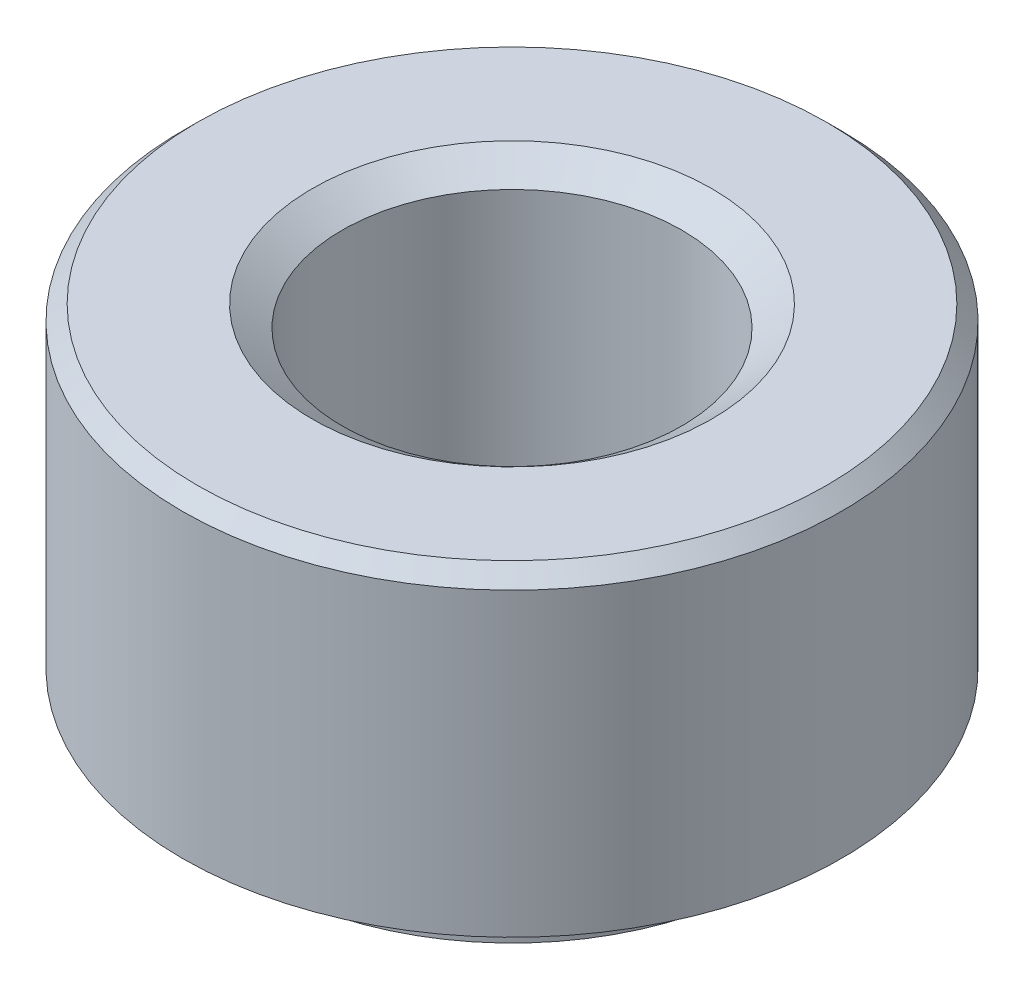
ISO-10303-21;
HEADER;
FILE_DESCRIPTION(('STEP AP214'),'2;1');
FILE_NAME('part.step','',(''),(''),'','','');
FILE_SCHEMA(('AUTOMOTIVE_DESIGN { 1 0 10303 214 1 1 1 1 }'));
ENDSEC;
DATA;
#1=APPLICATION_CONTEXT('core data for automotive mechanical design processes');
#2=APPLICATION_PROTOCOL_DEFINITION('international standard','automotive_design',2000,#1);
#3=PRODUCT_CONTEXT('',#1,'mechanical');
#4=PRODUCT('Part','Part','',(#3));
#5=PRODUCT_RELATED_PRODUCT_CATEGORY('part','',(#4));
#6=PRODUCT_DEFINITION_FORMATION('','',#4);
#7=PRODUCT_DEFINITION_CONTEXT('part definition',#1,'design');
#8=PRODUCT_DEFINITION('design','',#6,#7);
#9=PRODUCT_DEFINITION_SHAPE('','',#8);
#10=(LENGTH_UNIT() NAMED_UNIT(*) SI_UNIT(.MILLI.,.METRE.));
#11=(NAMED_UNIT(*) PLANE_ANGLE_UNIT() SI_UNIT($,.RADIAN.));
#12=(NAMED_UNIT(*) SI_UNIT($,.STERADIAN.) SOLID_ANGLE_UNIT());
#13=UNCERTAINTY_MEASURE_WITH_UNIT(LENGTH_MEASURE(1.E-05),#10,'distance_accuracy_value','');
#14=(GEOMETRIC_REPRESENTATION_CONTEXT(3) GLOBAL_UNCERTAINTY_ASSIGNED_CONTEXT((#13)) GLOBAL_UNIT_ASSIGNED_CONTEXT((#10,
#11,#12)) REPRESENTATION_CONTEXT('',''));
#15=CARTESIAN_POINT('',(0.,0.,0.));
#16=DIRECTION('',(0.,0.,1.));
#17=DIRECTION('',(1.,0.,0.));
#18=AXIS2_PLACEMENT_3D('',#15,#16,#17);
#19=CARTESIAN_POINT('',(0.,0.,0.));
#20=DIRECTION('',(0.,-1.,0.));
#21=DIRECTION('',(0.,0.,-1.));
#22=AXIS2_PLACEMENT_3D('',#19,#20,#21);
#23=CYLINDRICAL_SURFACE('',#22,7.2925);
#24=DIRECTION('',(0.,-1.,0.));
#25=VECTOR('',#24,1.);
#26=CARTESIAN_POINT('',(-7.29135648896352,-0.296,0.129138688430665));
#27=LINE('',#26,#25);
#28=CARTESIAN_POINT('',(-7.29135648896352,0.,0.129138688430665));
#29=VERTEX_POINT('',#28);
#30=CARTESIAN_POINT('',(-7.29135648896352,-0.592,0.129138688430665));
#31=VERTEX_POINT('',#30);
#32=EDGE_CURVE('E11',#29,#31,#27,.T.);
#33=ORIENTED_EDGE('',*,*,#32,.F.);
#34=CARTESIAN_POINT('',(0.,0.,0.));
#35=DIRECTION('',(0.,-1.,0.));
#36=DIRECTION('',(0.,0.,-1.));
#37=AXIS2_PLACEMENT_3D('',#34,#35,#36);
#38=CIRCLE('',#37,7.2925);
#39=CARTESIAN_POINT('',(-7.29135648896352,0.,-0.129138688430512));
#40=VERTEX_POINT('',#39);
#41=EDGE_CURVE('E541',#29,#40,#38,.T.);
#42=ORIENTED_EDGE('',*,*,#41,.T.);
#43=DIRECTION('',(0.,-1.,0.));
#44=VECTOR('',#43,1.);
#45=CARTESIAN_POINT('',(-7.29135648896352,-0.296,-0.129138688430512));
#46=LINE('',#45,#44);
#47=CARTESIAN_POINT('',(-7.29135648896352,-0.592,-0.129138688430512));
#48=VERTEX_POINT('',#47);
#49=EDGE_CURVE('E486',#48,#40,#46,.F.);
#50=ORIENTED_EDGE('',*,*,#49,.F.);
#51=CARTESIAN_POINT('',(0.,-0.592,0.));
#52=DIRECTION('',(0.,-1.,0.));
#53=DIRECTION('',(0.,0.,-1.));
#54=AXIS2_PLACEMENT_3D('',#51,#52,#53);
#55=CIRCLE('',#54,7.2925);
#56=EDGE_CURVE('E839',#31,#48,#55,.T.);
#57=ORIENTED_EDGE('',*,*,#56,.F.);
#58=EDGE_LOOP('',(#33,#42,#50,#57));
#59=FACE_BOUND('',#58,.T.);
#60=ADVANCED_FACE('F39',(#59),#23,.T.);
#61=DIRECTION('',(0.,-1.,0.));
#62=VECTOR('',#61,1.);
#63=CARTESIAN_POINT('',(-6.24993060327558,-0.296,3.75751562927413));
#64=LINE('',#63,#62);
#65=CARTESIAN_POINT('',(-6.24993060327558,0.,3.75751562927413));
#66=VERTEX_POINT('',#65);
#67=CARTESIAN_POINT('',(-6.24993060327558,-0.592,3.75751562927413));
#68=VERTEX_POINT('',#67);
#69=EDGE_CURVE('E524',#66,#68,#64,.T.);
#70=ORIENTED_EDGE('',*,*,#69,.F.);
#71=CARTESIAN_POINT('',(-6.37906929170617,0.,3.53384085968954));
#72=VERTEX_POINT('',#71);
#73=EDGE_CURVE('E540',#66,#72,#38,.T.);
#74=ORIENTED_EDGE('',*,*,#73,.T.);
#75=DIRECTION('',(0.,-1.,0.));
#76=VECTOR('',#75,1.);
#77=CARTESIAN_POINT('',(-6.37906929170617,-0.296,3.53384085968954));
#78=LINE('',#77,#76);
#79=CARTESIAN_POINT('',(-6.37906929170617,-0.592,3.53384085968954));
#80=VERTEX_POINT('',#79);
#81=EDGE_CURVE('E516',#80,#72,#78,.F.);
#82=ORIENTED_EDGE('',*,*,#81,.F.);
#83=EDGE_CURVE('E836',#68,#80,#55,.T.);
#84=ORIENTED_EDGE('',*,*,#83,.F.);
#85=EDGE_LOOP('',(#70,#74,#82,#84));
#86=FACE_BOUND('',#85,.T.);
#87=ADVANCED_FACE('F759',(#86),#23,.T.);
#88=DIRECTION('',(0.,-1.,0.));
#89=VECTOR('',#88,1.);
#90=CARTESIAN_POINT('',(-7.07633309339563,-0.296,1.76240352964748));
#91=LINE('',#90,#89);
#92=CARTESIAN_POINT('',(-7.07633309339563,-0.592,1.76240352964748));
#93=VERTEX_POINT('',#92);
#94=CARTESIAN_POINT('',(-7.07633309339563,0.,1.76240352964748));
#95=VERTEX_POINT('',#94);
#96=EDGE_CURVE('E47',#93,#95,#91,.F.);
#97=ORIENTED_EDGE('',*,*,#96,.F.);
#98=CARTESIAN_POINT('',(-7.00948598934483,-0.592,2.01188031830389));
#99=VERTEX_POINT('',#98);
#100=EDGE_CURVE('E837',#99,#93,#55,.T.);
#101=ORIENTED_EDGE('',*,*,#100,.F.);
#102=DIRECTION('',(0.,-1.,0.));
#103=VECTOR('',#102,1.);
#104=CARTESIAN_POINT('',(-7.00948598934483,-0.296,2.01188031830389));
#105=LINE('',#104,#103);
#106=CARTESIAN_POINT('',(-7.00948598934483,0.,2.01188031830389));
#107=VERTEX_POINT('',#106);
#108=EDGE_CURVE('E519',#107,#99,#105,.T.);
#109=ORIENTED_EDGE('',*,*,#108,.F.);
#110=EDGE_CURVE('E538',#107,#95,#38,.T.);
#111=ORIENTED_EDGE('',*,*,#110,.T.);
#112=EDGE_LOOP('',(#97,#101,#109,#111));
#113=FACE_BOUND('',#112,.T.);
#114=ADVANCED_FACE('F539',(#113),#23,.T.);
#115=DIRECTION('',(0.,-1.,0.));
#116=VECTOR('',#115,1.);
#117=CARTESIAN_POINT('',(-1.76240352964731,-0.296,7.07633309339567));
#118=LINE('',#117,#116);
#119=CARTESIAN_POINT('',(-1.76240352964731,0.,7.07633309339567));
#120=VERTEX_POINT('',#119);
#121=CARTESIAN_POINT('',(-1.76240352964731,-0.592,7.07633309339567));
#122=VERTEX_POINT('',#121);
#123=EDGE_CURVE('E514',#120,#122,#118,.T.);
#124=ORIENTED_EDGE('',*,*,#123,.F.);
#125=CARTESIAN_POINT('',(-2.01188031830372,0.,7.00948598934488));
#126=VERTEX_POINT('',#125);
#127=EDGE_CURVE('E634',#120,#126,#38,.T.);
#128=ORIENTED_EDGE('',*,*,#127,.T.);
#129=DIRECTION('',(0.,-1.,0.));
#130=VECTOR('',#129,1.);
#131=CARTESIAN_POINT('',(-2.01188031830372,-0.296,7.00948598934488));
#132=LINE('',#131,#130);
#133=CARTESIAN_POINT('',(-2.01188031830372,-0.592,7.00948598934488));
#134=VERTEX_POINT('',#133);
#135=EDGE_CURVE('E506',#134,#126,#132,.F.);
#136=ORIENTED_EDGE('',*,*,#135,.F.);
#137=EDGE_CURVE('E382',#122,#134,#55,.T.);
#138=ORIENTED_EDGE('',*,*,#137,.F.);
#139=EDGE_LOOP('',(#124,#128,#136,#138));
#140=FACE_BOUND('',#139,.T.);
#141=ADVANCED_FACE('F832',(#140),#23,.T.);
#142=DIRECTION('',(0.,-1.,0.));
#143=VECTOR('',#142,1.);
#144=CARTESIAN_POINT('',(-3.53384085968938,-0.296,6.37906929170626));
#145=LINE('',#144,#143);
#146=CARTESIAN_POINT('',(-3.53384085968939,0.,6.37906929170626));
#147=VERTEX_POINT('',#146);
#148=CARTESIAN_POINT('',(-3.53384085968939,-0.592,6.37906929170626));
#149=VERTEX_POINT('',#148);
#150=EDGE_CURVE('E509',#147,#149,#145,.T.);
#151=ORIENTED_EDGE('',*,*,#150,.F.);
#152=CARTESIAN_POINT('',(-3.75751562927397,0.,6.24993060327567));
#153=VERTEX_POINT('',#152);
#154=EDGE_CURVE('E641',#147,#153,#38,.T.);
#155=ORIENTED_EDGE('',*,*,#154,.T.);
#156=DIRECTION('',(0.,-1.,0.));
#157=VECTOR('',#156,1.);
#158=CARTESIAN_POINT('',(-3.75751562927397,-0.296,6.24993060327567));
#159=LINE('',#158,#157);
#160=CARTESIAN_POINT('',(-3.75751562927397,-0.592,6.24993060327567));
#161=VERTEX_POINT('',#160);
#162=EDGE_CURVE('E501',#161,#153,#159,.F.);
#163=ORIENTED_EDGE('',*,*,#162,.F.);
#164=EDGE_CURVE('E833',#149,#161,#55,.T.);
#165=ORIENTED_EDGE('',*,*,#164,.F.);
#166=EDGE_LOOP('',(#151,#155,#163,#165));
#167=FACE_BOUND('',#166,.T.);
#168=ADVANCED_FACE('F1160',(#167),#23,.T.);
#169=DIRECTION('',(0.,-1.,0.));
#170=VECTOR('',#169,1.);
#171=CARTESIAN_POINT('',(-5.24708245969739,-0.296,5.0644527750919));
#172=LINE('',#171,#170);
#173=CARTESIAN_POINT('',(-5.24708245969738,-0.592,5.0644527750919));
#174=VERTEX_POINT('',#173);
#175=CARTESIAN_POINT('',(-5.24708245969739,0.,5.0644527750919));
#176=VERTEX_POINT('',#175);
#177=EDGE_CURVE('E521',#174,#176,#172,.F.);
#178=ORIENTED_EDGE('',*,*,#177,.F.);
#179=CARTESIAN_POINT('',(-5.06445277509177,-0.592,5.24708245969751));
#180=VERTEX_POINT('',#179);
#181=EDGE_CURVE('E834',#180,#174,#55,.T.);
#182=ORIENTED_EDGE('',*,*,#181,.F.);
#183=DIRECTION('',(0.,-1.,0.));
#184=VECTOR('',#183,1.);
#185=CARTESIAN_POINT('',(-5.06445277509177,-0.296,5.24708245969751));
#186=LINE('',#185,#184);
#187=CARTESIAN_POINT('',(-5.06445277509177,0.,5.24708245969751));
#188=VERTEX_POINT('',#187);
#189=EDGE_CURVE('E504',#188,#180,#186,.T.);
#190=ORIENTED_EDGE('',*,*,#189,.F.);
#191=EDGE_CURVE('E543',#188,#176,#38,.T.);
#192=ORIENTED_EDGE('',*,*,#191,.T.);
#193=EDGE_LOOP('',(#178,#182,#190,#192));
#194=FACE_BOUND('',#193,.T.);
#195=ADVANCED_FACE('F656',(#194),#23,.T.);
#196=DIRECTION('',(0.,-1.,0.));
#197=VECTOR('',#196,1.);
#198=CARTESIAN_POINT('',(-3.75751562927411,-0.296,-6.24993060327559));
#199=LINE('',#198,#197);
#200=CARTESIAN_POINT('',(-3.7575156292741,0.,-6.24993060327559));
#201=VERTEX_POINT('',#200);
#202=CARTESIAN_POINT('',(-3.7575156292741,-0.592,-6.24993060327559));
#203=VERTEX_POINT('',#202);
#204=EDGE_CURVE('E499',#201,#203,#199,.T.);
#205=ORIENTED_EDGE('',*,*,#204,.F.);
#206=CARTESIAN_POINT('',(-3.53384085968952,0.,-6.37906929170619));
#207=VERTEX_POINT('',#206);
#208=EDGE_CURVE('E562',#201,#207,#38,.T.);
#209=ORIENTED_EDGE('',*,*,#208,.T.);
#210=DIRECTION('',(0.,-1.,0.));
#211=VECTOR('',#210,1.);
#212=CARTESIAN_POINT('',(-3.53384085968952,-0.296,-6.37906929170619));
#213=LINE('',#212,#211);
#214=CARTESIAN_POINT('',(-3.53384085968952,-0.592,-6.37906929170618));
#215=VERTEX_POINT('',#214);
#216=EDGE_CURVE('E491',#215,#207,#213,.F.);
#217=ORIENTED_EDGE('',*,*,#216,.F.);
#218=EDGE_CURVE('E852',#203,#215,#55,.T.);
#219=ORIENTED_EDGE('',*,*,#218,.F.);
#220=EDGE_LOOP('',(#205,#209,#217,#219));
#221=FACE_BOUND('',#220,.T.);
#222=ADVANCED_FACE('F1147',(#221),#23,.T.);
#223=DIRECTION('',(0.,-1.,0.));
#224=VECTOR('',#223,1.);
#225=CARTESIAN_POINT('',(-2.01188031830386,-0.296,-7.00948598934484));
#226=LINE('',#225,#224);
#227=CARTESIAN_POINT('',(-2.01188031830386,0.,-7.00948598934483));
#228=VERTEX_POINT('',#227);
#229=CARTESIAN_POINT('',(-2.01188031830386,-0.592,-7.00948598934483));
#230=VERTEX_POINT('',#229);
#231=EDGE_CURVE('E494',#228,#230,#226,.T.);
#232=ORIENTED_EDGE('',*,*,#231,.F.);
#233=CARTESIAN_POINT('',(-1.76240352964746,0.,-7.07633309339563));
#234=VERTEX_POINT('',#233);
#235=EDGE_CURVE('E568',#228,#234,#38,.T.);
#236=ORIENTED_EDGE('',*,*,#235,.T.);
#237=DIRECTION('',(0.,-1.,0.));
#238=VECTOR('',#237,1.);
#239=CARTESIAN_POINT('',(-1.76240352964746,-0.296,-7.07633309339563));
#240=LINE('',#239,#238);
#241=CARTESIAN_POINT('',(-1.76240352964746,-0.592,-7.07633309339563));
#242=VERTEX_POINT('',#241);
#243=EDGE_CURVE('E446',#242,#234,#240,.F.);
#244=ORIENTED_EDGE('',*,*,#243,.F.);
#245=EDGE_CURVE('E856',#230,#242,#55,.T.);
#246=ORIENTED_EDGE('',*,*,#245,.F.);
#247=EDGE_LOOP('',(#232,#236,#244,#246));
#248=FACE_BOUND('',#247,.T.);
#249=ADVANCED_FACE('F1139',(#248),#23,.T.);
#250=DIRECTION('',(0.,-1.,0.));
#251=VECTOR('',#250,1.);
#252=CARTESIAN_POINT('',(-7.07633309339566,-0.296,-1.76240352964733));
#253=LINE('',#252,#251);
#254=CARTESIAN_POINT('',(-7.07633309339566,0.,-1.76240352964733));
#255=VERTEX_POINT('',#254);
#256=CARTESIAN_POINT('',(-7.07633309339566,-0.592,-1.76240352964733));
#257=VERTEX_POINT('',#256);
#258=EDGE_CURVE('E489',#255,#257,#253,.T.);
#259=ORIENTED_EDGE('',*,*,#258,.F.);
#260=CARTESIAN_POINT('',(-7.00948598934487,0.,-2.01188031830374));
#261=VERTEX_POINT('',#260);
#262=EDGE_CURVE('E545',#255,#261,#38,.T.);
#263=ORIENTED_EDGE('',*,*,#262,.T.);
#264=DIRECTION('',(0.,-1.,0.));
#265=VECTOR('',#264,1.);
#266=CARTESIAN_POINT('',(-7.00948598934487,-0.296,-2.01188031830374));
#267=LINE('',#266,#265);
#268=CARTESIAN_POINT('',(-7.00948598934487,-0.592,-2.01188031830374));
#269=VERTEX_POINT('',#268);
#270=EDGE_CURVE('E481',#269,#261,#267,.F.);
#271=ORIENTED_EDGE('',*,*,#270,.F.);
#272=EDGE_CURVE('E841',#257,#269,#55,.T.);
#273=ORIENTED_EDGE('',*,*,#272,.F.);
#274=EDGE_LOOP('',(#259,#263,#271,#273));
#275=FACE_BOUND('',#274,.T.);
#276=ADVANCED_FACE('F1131',(#275),#23,.T.);
#277=DIRECTION('',(0.,-1.,0.));
#278=VECTOR('',#277,1.);
#279=CARTESIAN_POINT('',(-6.37906929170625,-0.296,-3.53384085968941));
#280=LINE('',#279,#278);
#281=CARTESIAN_POINT('',(-6.37906929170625,0.,-3.53384085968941));
#282=VERTEX_POINT('',#281);
#283=CARTESIAN_POINT('',(-6.37906929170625,-0.592,-3.53384085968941));
#284=VERTEX_POINT('',#283);
#285=EDGE_CURVE('E484',#282,#284,#280,.T.);
#286=ORIENTED_EDGE('',*,*,#285,.F.);
#287=CARTESIAN_POINT('',(-6.24993060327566,0.,-3.757515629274));
#288=VERTEX_POINT('',#287);
#289=EDGE_CURVE('E550',#282,#288,#38,.T.);
#290=ORIENTED_EDGE('',*,*,#289,.T.);
#291=DIRECTION('',(0.,-1.,0.));
#292=VECTOR('',#291,1.);
#293=CARTESIAN_POINT('',(-6.24993060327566,-0.296,-3.757515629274));
#294=LINE('',#293,#292);
#295=CARTESIAN_POINT('',(-6.24993060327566,-0.592,-3.75751562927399));
#296=VERTEX_POINT('',#295);
#297=EDGE_CURVE('E476',#296,#288,#294,.F.);
#298=ORIENTED_EDGE('',*,*,#297,.F.);
#299=EDGE_CURVE('E844',#284,#296,#55,.T.);
#300=ORIENTED_EDGE('',*,*,#299,.F.);
#301=EDGE_LOOP('',(#286,#290,#298,#300));
#302=FACE_BOUND('',#301,.T.);
#303=ADVANCED_FACE('F1123',(#302),#23,.T.);
#304=DIRECTION('',(0.,-1.,0.));
#305=VECTOR('',#304,1.);
#306=CARTESIAN_POINT('',(-5.06445277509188,-0.296,-5.2470824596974));
#307=LINE('',#306,#305);
#308=CARTESIAN_POINT('',(-5.06445277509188,-0.592,-5.2470824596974));
#309=VERTEX_POINT('',#308);
#310=CARTESIAN_POINT('',(-5.06445277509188,0.,-5.2470824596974));
#311=VERTEX_POINT('',#310);
#312=EDGE_CURVE('E496',#309,#311,#307,.F.);
#313=ORIENTED_EDGE('',*,*,#312,.F.);
#314=CARTESIAN_POINT('',(-5.24708245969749,-0.592,-5.06445277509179));
#315=VERTEX_POINT('',#314);
#316=EDGE_CURVE('E848',#315,#309,#55,.T.);
#317=ORIENTED_EDGE('',*,*,#316,.F.);
#318=DIRECTION('',(0.,-1.,0.));
#319=VECTOR('',#318,1.);
#320=CARTESIAN_POINT('',(-5.24708245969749,-0.296,-5.06445277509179));
#321=LINE('',#320,#319);
#322=CARTESIAN_POINT('',(-5.24708245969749,0.,-5.06445277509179));
#323=VERTEX_POINT('',#322);
#324=EDGE_CURVE('E479',#323,#315,#321,.T.);
#325=ORIENTED_EDGE('',*,*,#324,.F.);
#326=EDGE_CURVE('E556',#323,#311,#38,.T.);
#327=ORIENTED_EDGE('',*,*,#326,.T.);
#328=EDGE_LOOP('',(#313,#317,#325,#327));
#329=FACE_BOUND('',#328,.T.);
#330=ADVANCED_FACE('F1115',(#329),#23,.T.);
#331=DIRECTION('',(0.,-1.,0.));
#332=VECTOR('',#331,1.);
#333=CARTESIAN_POINT('',(6.24993060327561,-0.296,-3.75751562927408));
#334=LINE('',#333,#332);
#335=CARTESIAN_POINT('',(6.24993060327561,0.,-3.75751562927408));
#336=VERTEX_POINT('',#335);
#337=CARTESIAN_POINT('',(6.24993060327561,-0.592,-3.75751562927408));
#338=VERTEX_POINT('',#337);
#339=EDGE_CURVE('E474',#336,#338,#334,.T.);
#340=ORIENTED_EDGE('',*,*,#339,.F.);
#341=CARTESIAN_POINT('',(6.3790692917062,0.,-3.5338408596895));
#342=VERTEX_POINT('',#341);
#343=EDGE_CURVE('E598',#336,#342,#38,.T.);
#344=ORIENTED_EDGE('',*,*,#343,.T.);
#345=DIRECTION('',(0.,-1.,0.));
#346=VECTOR('',#345,1.);
#347=CARTESIAN_POINT('',(6.3790692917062,-0.296,-3.5338408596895));
#348=LINE('',#347,#346);
#349=CARTESIAN_POINT('',(6.3790692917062,-0.592,-3.5338408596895));
#350=VERTEX_POINT('',#349);
#351=EDGE_CURVE('E461',#350,#342,#348,.F.);
#352=ORIENTED_EDGE('',*,*,#351,.F.);
#353=EDGE_CURVE('E372',#338,#350,#55,.T.);
#354=ORIENTED_EDGE('',*,*,#353,.F.);
#355=EDGE_LOOP('',(#340,#344,#352,#354));
#356=FACE_BOUND('',#355,.T.);
#357=ADVANCED_FACE('F881',(#356),#23,.T.);
#358=DIRECTION('',(0.,-1.,0.));
#359=VECTOR('',#358,1.);
#360=CARTESIAN_POINT('',(5.24708245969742,-0.296,-5.06445277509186));
#361=LINE('',#360,#359);
#362=CARTESIAN_POINT('',(5.24708245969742,-0.592,-5.06445277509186));
#363=VERTEX_POINT('',#362);
#364=CARTESIAN_POINT('',(5.24708245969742,0.,-5.06445277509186));
#365=VERTEX_POINT('',#364);
#366=EDGE_CURVE('E471',#363,#365,#361,.F.);
#367=ORIENTED_EDGE('',*,*,#366,.F.);
#368=CARTESIAN_POINT('',(5.06445277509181,-0.592,-5.24708245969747));
#369=VERTEX_POINT('',#368);
#370=EDGE_CURVE('E375',#369,#363,#55,.T.);
#371=ORIENTED_EDGE('',*,*,#370,.F.);
#372=DIRECTION('',(0.,-1.,0.));
#373=VECTOR('',#372,1.);
#374=CARTESIAN_POINT('',(5.06445277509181,-0.296,-5.24708245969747));
#375=LINE('',#374,#373);
#376=CARTESIAN_POINT('',(5.06445277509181,0.,-5.24708245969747));
#377=VERTEX_POINT('',#376);
#378=EDGE_CURVE('E469',#377,#369,#375,.T.);
#379=ORIENTED_EDGE('',*,*,#378,.F.);
#380=EDGE_CURVE('E592',#377,#365,#38,.T.);
#381=ORIENTED_EDGE('',*,*,#380,.T.);
#382=EDGE_LOOP('',(#367,#371,#379,#381));
#383=FACE_BOUND('',#382,.T.);
#384=ADVANCED_FACE('F878',(#383),#23,.T.);
#385=DIRECTION('',(0.,-1.,0.));
#386=VECTOR('',#385,1.);
#387=CARTESIAN_POINT('',(7.00948598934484,-0.296,-2.01188031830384));
#388=LINE('',#387,#386);
#389=CARTESIAN_POINT('',(7.00948598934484,0.,-2.01188031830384));
#390=VERTEX_POINT('',#389);
#391=CARTESIAN_POINT('',(7.00948598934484,-0.592,-2.01188031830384));
#392=VERTEX_POINT('',#391);
#393=EDGE_CURVE('E464',#390,#392,#388,.T.);
#394=ORIENTED_EDGE('',*,*,#393,.F.);
#395=CARTESIAN_POINT('',(7.07633309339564,0.,-1.76240352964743));
#396=VERTEX_POINT('',#395);
#397=EDGE_CURVE('E363',#390,#396,#38,.T.);
#398=ORIENTED_EDGE('',*,*,#397,.T.);
#399=DIRECTION('',(0.,-1.,0.));
#400=VECTOR('',#399,1.);
#401=CARTESIAN_POINT('',(7.07633309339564,-0.296,-1.76240352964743));
#402=LINE('',#401,#400);
#403=CARTESIAN_POINT('',(7.07633309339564,-0.592,-1.76240352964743));
#404=VERTEX_POINT('',#403);
#405=EDGE_CURVE('E346',#404,#396,#402,.F.);
#406=ORIENTED_EDGE('',*,*,#405,.F.);
#407=EDGE_CURVE('E361',#392,#404,#55,.T.);
#408=ORIENTED_EDGE('',*,*,#407,.F.);
#409=EDGE_LOOP('',(#394,#398,#406,#408));
#410=FACE_BOUND('',#409,.T.);
#411=ADVANCED_FACE('F360',(#410),#23,.T.);
#412=DIRECTION('',(0.,-1.,0.));
#413=VECTOR('',#412,1.);
#414=CARTESIAN_POINT('',(3.75751562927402,-0.296,-6.24993060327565));
#415=LINE('',#414,#413);
#416=CARTESIAN_POINT('',(3.75751562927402,-0.592,-6.24993060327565));
#417=VERTEX_POINT('',#416);
#418=CARTESIAN_POINT('',(3.75751562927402,0.,-6.24993060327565));
#419=VERTEX_POINT('',#418);
#420=EDGE_CURVE('E466',#417,#419,#415,.F.);
#421=ORIENTED_EDGE('',*,*,#420,.F.);
#422=CARTESIAN_POINT('',(3.53384085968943,-0.592,-6.37906929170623));
#423=VERTEX_POINT('',#422);
#424=EDGE_CURVE('E868',#423,#417,#55,.T.);
#425=ORIENTED_EDGE('',*,*,#424,.F.);
#426=DIRECTION('',(0.,-1.,0.));
#427=VECTOR('',#426,1.);
#428=CARTESIAN_POINT('',(3.53384085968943,-0.296,-6.37906929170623));
#429=LINE('',#428,#427);
#430=CARTESIAN_POINT('',(3.53384085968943,0.,-6.37906929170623));
#431=VERTEX_POINT('',#430);
#432=EDGE_CURVE('E459',#431,#423,#429,.T.);
#433=ORIENTED_EDGE('',*,*,#432,.F.);
#434=EDGE_CURVE('E586',#431,#419,#38,.T.);
#435=ORIENTED_EDGE('',*,*,#434,.T.);
#436=EDGE_LOOP('',(#421,#425,#433,#435));
#437=FACE_BOUND('',#436,.T.);
#438=ADVANCED_FACE('F1089',(#437),#23,.T.);
#439=DIRECTION('',(0.,-1.,0.));
#440=VECTOR('',#439,1.);
#441=CARTESIAN_POINT('',(2.01188031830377,-0.296,-7.00948598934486));
#442=LINE('',#441,#440);
#443=CARTESIAN_POINT('',(2.01188031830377,-0.592,-7.00948598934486));
#444=VERTEX_POINT('',#443);
#445=CARTESIAN_POINT('',(2.01188031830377,0.,-7.00948598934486));
#446=VERTEX_POINT('',#445);
#447=EDGE_CURVE('E456',#444,#446,#442,.F.);
#448=ORIENTED_EDGE('',*,*,#447,.F.);
#449=CARTESIAN_POINT('',(1.76240352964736,-0.592,-7.07633309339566));
#450=VERTEX_POINT('',#449);
#451=EDGE_CURVE('E864',#450,#444,#55,.T.);
#452=ORIENTED_EDGE('',*,*,#451,.F.);
#453=DIRECTION('',(0.,-1.,0.));
#454=VECTOR('',#453,1.);
#455=CARTESIAN_POINT('',(1.76240352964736,-0.296,-7.07633309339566));
#456=LINE('',#455,#454);
#457=CARTESIAN_POINT('',(1.76240352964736,0.,-7.07633309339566));
#458=VERTEX_POINT('',#457);
#459=EDGE_CURVE('E454',#458,#450,#456,.T.);
#460=ORIENTED_EDGE('',*,*,#459,.F.);
#461=EDGE_CURVE('E580',#458,#446,#38,.T.);
#462=ORIENTED_EDGE('',*,*,#461,.T.);
#463=EDGE_LOOP('',(#448,#452,#460,#462));
#464=FACE_BOUND('',#463,.T.);
#465=ADVANCED_FACE('F1081',(#464),#23,.T.);
#466=DIRECTION('',(0.,-1.,0.));
#467=VECTOR('',#466,1.);
#468=CARTESIAN_POINT('',(0.129138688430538,-0.296,-7.29135648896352));
#469=LINE('',#468,#467);
#470=CARTESIAN_POINT('',(0.129138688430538,-0.592,-7.29135648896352));
#471=VERTEX_POINT('',#470);
#472=CARTESIAN_POINT('',(0.129138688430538,0.,-7.29135648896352));
#473=VERTEX_POINT('',#472);
#474=EDGE_CURVE('E451',#471,#473,#469,.F.);
#475=ORIENTED_EDGE('',*,*,#474,.F.);
#476=CARTESIAN_POINT('',(-0.12913868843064,-0.592,-7.29135648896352));
#477=VERTEX_POINT('',#476);
#478=EDGE_CURVE('E860',#477,#471,#55,.T.);
#479=ORIENTED_EDGE('',*,*,#478,.F.);
#480=DIRECTION('',(0.,-1.,0.));
#481=VECTOR('',#480,1.);
#482=CARTESIAN_POINT('',(-0.12913868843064,-0.296,-7.29135648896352));
#483=LINE('',#482,#481);
#484=CARTESIAN_POINT('',(-0.12913868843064,0.,-7.29135648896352));
#485=VERTEX_POINT('',#484);
#486=EDGE_CURVE('E449',#485,#477,#483,.T.);
#487=ORIENTED_EDGE('',*,*,#486,.F.);
#488=EDGE_CURVE('E574',#485,#473,#38,.T.);
#489=ORIENTED_EDGE('',*,*,#488,.T.);
#490=EDGE_LOOP('',(#475,#479,#487,#489));
#491=FACE_BOUND('',#490,.T.);
#492=ADVANCED_FACE('F1074',(#491),#23,.T.);
#493=DIRECTION('',(0.,-1.,0.));
#494=VECTOR('',#493,1.);
#495=CARTESIAN_POINT('',(5.24708245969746,-0.296,5.06445277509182));
#496=LINE('',#495,#494);
#497=CARTESIAN_POINT('',(5.24708245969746,0.,5.06445277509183));
#498=VERTEX_POINT('',#497);
#499=CARTESIAN_POINT('',(5.24708245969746,-0.592,5.06445277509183));
#500=VERTEX_POINT('',#499);
#501=EDGE_CURVE('E444',#498,#500,#496,.T.);
#502=ORIENTED_EDGE('',*,*,#501,.F.);
#503=CARTESIAN_POINT('',(5.06445277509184,0.,5.24708245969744));
#504=VERTEX_POINT('',#503);
#505=EDGE_CURVE('E621',#498,#504,#38,.T.);
#506=ORIENTED_EDGE('',*,*,#505,.T.);
#507=DIRECTION('',(0.,-1.,0.));
#508=VECTOR('',#507,1.);
#509=CARTESIAN_POINT('',(5.06445277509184,-0.296,5.24708245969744));
#510=LINE('',#509,#508);
#511=CARTESIAN_POINT('',(5.06445277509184,-0.592,5.24708245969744));
#512=VERTEX_POINT('',#511);
#513=EDGE_CURVE('E438',#512,#504,#510,.F.);
#514=ORIENTED_EDGE('',*,*,#513,.F.);
#515=EDGE_CURVE('E1398',#500,#512,#55,.T.);
#516=ORIENTED_EDGE('',*,*,#515,.F.);
#517=EDGE_LOOP('',(#502,#506,#514,#516));
#518=FACE_BOUND('',#517,.T.);
#519=ADVANCED_FACE('F1067',(#518),#23,.T.);
#520=DIRECTION('',(0.,-1.,0.));
#521=VECTOR('',#520,1.);
#522=CARTESIAN_POINT('',(3.75751562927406,-0.296,6.24993060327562));
#523=LINE('',#522,#521);
#524=CARTESIAN_POINT('',(3.75751562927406,0.,6.24993060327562));
#525=VERTEX_POINT('',#524);
#526=CARTESIAN_POINT('',(3.75751562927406,-0.592,6.24993060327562));
#527=VERTEX_POINT('',#526);
#528=EDGE_CURVE('E440',#525,#527,#523,.T.);
#529=ORIENTED_EDGE('',*,*,#528,.F.);
#530=CARTESIAN_POINT('',(3.53384085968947,0.,6.37906929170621));
#531=VERTEX_POINT('',#530);
#532=EDGE_CURVE('E626',#525,#531,#38,.T.);
#533=ORIENTED_EDGE('',*,*,#532,.T.);
#534=DIRECTION('',(0.,-1.,0.));
#535=VECTOR('',#534,1.);
#536=CARTESIAN_POINT('',(3.53384085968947,-0.296,6.37906929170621));
#537=LINE('',#536,#535);
#538=CARTESIAN_POINT('',(3.53384085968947,-0.592,6.37906929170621));
#539=VERTEX_POINT('',#538);
#540=EDGE_CURVE('E423',#539,#531,#537,.F.);
#541=ORIENTED_EDGE('',*,*,#540,.F.);
#542=EDGE_CURVE('E383',#527,#539,#55,.T.);
#543=ORIENTED_EDGE('',*,*,#542,.F.);
#544=EDGE_LOOP('',(#529,#533,#541,#543));
#545=FACE_BOUND('',#544,.T.);
#546=ADVANCED_FACE('F1059',(#545),#23,.T.);
#547=DIRECTION('',(0.,-1.,0.));
#548=VECTOR('',#547,1.);
#549=CARTESIAN_POINT('',(6.24993060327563,-0.296,3.75751562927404));
#550=LINE('',#549,#548);
#551=CARTESIAN_POINT('',(6.24993060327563,-0.592,3.75751562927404));
#552=VERTEX_POINT('',#551);
#553=CARTESIAN_POINT('',(6.24993060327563,0.,3.75751562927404));
#554=VERTEX_POINT('',#553);
#555=EDGE_CURVE('E442',#552,#554,#550,.F.);
#556=ORIENTED_EDGE('',*,*,#555,.F.);
#557=CARTESIAN_POINT('',(6.37906929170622,-0.592,3.53384085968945));
#558=VERTEX_POINT('',#557);
#559=EDGE_CURVE('E1401',#558,#552,#55,.T.);
#560=ORIENTED_EDGE('',*,*,#559,.F.);
#561=DIRECTION('',(0.,-1.,0.));
#562=VECTOR('',#561,1.);
#563=CARTESIAN_POINT('',(6.37906929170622,-0.296,3.53384085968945));
#564=LINE('',#563,#562);
#565=CARTESIAN_POINT('',(6.37906929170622,0.,3.53384085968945));
#566=VERTEX_POINT('',#565);
#567=EDGE_CURVE('E436',#566,#558,#564,.T.);
#568=ORIENTED_EDGE('',*,*,#567,.F.);
#569=EDGE_CURVE('E615',#566,#554,#38,.T.);
#570=ORIENTED_EDGE('',*,*,#569,.T.);
#571=EDGE_LOOP('',(#556,#560,#568,#570));
#572=FACE_BOUND('',#571,.T.);
#573=ADVANCED_FACE('F1052',(#572),#23,.T.);
#574=DIRECTION('',(0.,-1.,0.));
#575=VECTOR('',#574,1.);
#576=CARTESIAN_POINT('',(7.00948598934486,-0.296,2.01188031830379));
#577=LINE('',#576,#575);
#578=CARTESIAN_POINT('',(7.00948598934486,-0.592,2.01188031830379));
#579=VERTEX_POINT('',#578);
#580=CARTESIAN_POINT('',(7.00948598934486,0.,2.01188031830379));
#581=VERTEX_POINT('',#580);
#582=EDGE_CURVE('E433',#579,#581,#577,.F.);
#583=ORIENTED_EDGE('',*,*,#582,.F.);
#584=CARTESIAN_POINT('',(7.07633309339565,-0.592,1.76240352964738));
#585=VERTEX_POINT('',#584);
#586=EDGE_CURVE('E376',#585,#579,#55,.T.);
#587=ORIENTED_EDGE('',*,*,#586,.F.);
#588=DIRECTION('',(0.,-1.,0.));
#589=VECTOR('',#588,1.);
#590=CARTESIAN_POINT('',(7.07633309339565,-0.296,1.76240352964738));
#591=LINE('',#590,#589);
#592=CARTESIAN_POINT('',(7.07633309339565,0.,1.76240352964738));
#593=VERTEX_POINT('',#592);
#594=EDGE_CURVE('E431',#593,#585,#591,.T.);
#595=ORIENTED_EDGE('',*,*,#594,.F.);
#596=EDGE_CURVE('E610',#593,#581,#38,.T.);
#597=ORIENTED_EDGE('',*,*,#596,.T.);
#598=EDGE_LOOP('',(#583,#587,#595,#597));
#599=FACE_BOUND('',#598,.T.);
#600=ADVANCED_FACE('F781',(#599),#23,.T.);
#601=DIRECTION('',(0.,-1.,0.));
#602=VECTOR('',#601,1.);
#603=CARTESIAN_POINT('',(7.29135648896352,-0.296,0.129138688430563));
#604=LINE('',#603,#602);
#605=CARTESIAN_POINT('',(7.29135648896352,-0.592,0.129138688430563));
#606=VERTEX_POINT('',#605);
#607=CARTESIAN_POINT('',(7.29135648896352,0.,0.129138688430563));
#608=VERTEX_POINT('',#607);
#609=EDGE_CURVE('E428',#606,#608,#604,.F.);
#610=ORIENTED_EDGE('',*,*,#609,.F.);
#611=CARTESIAN_POINT('',(7.29135648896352,-0.592,-0.129138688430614));
#612=VERTEX_POINT('',#611);
#613=EDGE_CURVE('E373',#612,#606,#55,.T.);
#614=ORIENTED_EDGE('',*,*,#613,.F.);
#615=DIRECTION('',(0.,-1.,0.));
#616=VECTOR('',#615,1.);
#617=CARTESIAN_POINT('',(7.29135648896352,-0.296,-0.129138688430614));
#618=LINE('',#617,#616);
#619=CARTESIAN_POINT('',(7.29135648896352,0.,-0.129138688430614));
#620=VERTEX_POINT('',#619);
#621=EDGE_CURVE('E349',#620,#612,#618,.T.);
#622=ORIENTED_EDGE('',*,*,#621,.F.);
#623=EDGE_CURVE('E608',#620,#608,#38,.T.);
#624=ORIENTED_EDGE('',*,*,#623,.T.);
#625=EDGE_LOOP('',(#610,#614,#622,#624));
#626=FACE_BOUND('',#625,.T.);
#627=ADVANCED_FACE('F774',(#626),#23,.T.);
#628=DIRECTION('',(0.,-1.,0.));
#629=VECTOR('',#628,1.);
#630=CARTESIAN_POINT('',(2.01188031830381,-0.296,7.00948598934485));
#631=LINE('',#630,#629);
#632=CARTESIAN_POINT('',(2.01188031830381,0.,7.00948598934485));
#633=VERTEX_POINT('',#632);
#634=CARTESIAN_POINT('',(2.01188031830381,-0.592,7.00948598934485));
#635=VERTEX_POINT('',#634);
#636=EDGE_CURVE('E364',#633,#635,#631,.T.);
#637=ORIENTED_EDGE('',*,*,#636,.F.);
#638=CARTESIAN_POINT('',(1.76240352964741,0.,7.07633309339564));
#639=VERTEX_POINT('',#638);
#640=EDGE_CURVE('E417',#633,#639,#38,.T.);
#641=ORIENTED_EDGE('',*,*,#640,.T.);
#642=DIRECTION('',(0.,-1.,0.));
#643=VECTOR('',#642,1.);
#644=CARTESIAN_POINT('',(1.76240352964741,-0.296,7.07633309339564));
#645=LINE('',#644,#643);
#646=CARTESIAN_POINT('',(1.76240352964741,-0.592,7.07633309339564));
#647=VERTEX_POINT('',#646);
#648=EDGE_CURVE('E413',#647,#639,#645,.F.);
#649=ORIENTED_EDGE('',*,*,#648,.F.);
#650=EDGE_CURVE('E384',#635,#647,#55,.T.);
#651=ORIENTED_EDGE('',*,*,#650,.F.);
#652=EDGE_LOOP('',(#637,#641,#649,#651));
#653=FACE_BOUND('',#652,.T.);
#654=ADVANCED_FACE('F767',(#653),#23,.T.);
#655=CARTESIAN_POINT('',(7.2925,0.,0.));
#656=DIRECTION('',(0.,-1.,0.));
#657=DIRECTION('',(0.,0.,-1.));
#658=AXIS2_PLACEMENT_3D('',#655,#656,#657);
#659=PLANE('',#658);
#660=ORIENTED_EDGE('',*,*,#41,.F.);
#661=CARTESIAN_POINT('',(-7.2301116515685,0.,0.951862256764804));
#662=DIRECTION('',(0.,-1.,0.));
#663=DIRECTION('',(1.,0.,0.));
#664=AXIS2_PLACEMENT_3D('',#661,#662,#663);
#665=CIRCLE('',#664,0.825);
#666=EDGE_CURVE('E530',#29,#95,#665,.T.);
#667=ORIENTED_EDGE('',*,*,#666,.T.);
#668=ORIENTED_EDGE('',*,*,#110,.F.);
#669=CARTESIAN_POINT('',(-6.73739149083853,0.,2.79071893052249));
#670=DIRECTION('',(0.,-1.,0.));
#671=DIRECTION('',(0.965925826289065,0.,-0.258819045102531));
#672=AXIS2_PLACEMENT_3D('',#669,#670,#671);
#673=CIRCLE('',#672,0.825);
#674=EDGE_CURVE('E678',#107,#72,#673,.T.);
#675=ORIENTED_EDGE('',*,*,#674,.T.);
#676=ORIENTED_EDGE('',*,*,#73,.F.);
#677=CARTESIAN_POINT('',(-5.78552923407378,0.,4.43939272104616));
#678=DIRECTION('',(0.,-1.,0.));
#679=DIRECTION('',(0.866025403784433,0.,-0.50000000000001));
#680=AXIS2_PLACEMENT_3D('',#677,#678,#679);
#681=CIRCLE('',#680,0.825);
#682=EDGE_CURVE('E663',#66,#176,#681,.T.);
#683=ORIENTED_EDGE('',*,*,#682,.T.);
#684=ORIENTED_EDGE('',*,*,#191,.F.);
#685=CARTESIAN_POINT('',(-4.43939272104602,0.,5.78552923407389));
#686=DIRECTION('',(0.,-1.,0.));
#687=DIRECTION('',(0.707106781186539,0.,-0.707106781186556));
#688=AXIS2_PLACEMENT_3D('',#685,#686,#687);
#689=CIRCLE('',#688,0.825);
#690=EDGE_CURVE('E661',#188,#153,#689,.T.);
#691=ORIENTED_EDGE('',*,*,#690,.T.);
#692=ORIENTED_EDGE('',*,*,#154,.F.);
#693=CARTESIAN_POINT('',(-2.79071893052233,0.,6.73739149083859));
#694=DIRECTION('',(0.,-1.,0.));
#695=DIRECTION('',(0.499999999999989,0.,-0.866025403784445));
#696=AXIS2_PLACEMENT_3D('',#693,#694,#695);
#697=CIRCLE('',#696,0.825);
#698=EDGE_CURVE('E805',#147,#126,#697,.T.);
#699=ORIENTED_EDGE('',*,*,#698,.T.);
#700=ORIENTED_EDGE('',*,*,#127,.F.);
#701=CARTESIAN_POINT('',(-0.951862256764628,0.,7.23011165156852));
#702=DIRECTION('',(0.,-1.,0.));
#703=DIRECTION('',(0.258819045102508,0.,-0.965925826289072));
#704=AXIS2_PLACEMENT_3D('',#701,#702,#703);
#705=CIRCLE('',#704,0.825);
#706=CARTESIAN_POINT('',(-0.129138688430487,0.,7.29135648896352));
#707=VERTEX_POINT('',#706);
#708=EDGE_CURVE('E795',#120,#707,#705,.T.);
#709=ORIENTED_EDGE('',*,*,#708,.T.);
#710=CARTESIAN_POINT('',(0.129138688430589,0.,7.29135648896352));
#711=VERTEX_POINT('',#710);
#712=EDGE_CURVE('E385',#711,#707,#38,.T.);
#713=ORIENTED_EDGE('',*,*,#712,.F.);
#714=CARTESIAN_POINT('',(0.951862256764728,0.,7.23011165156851));
#715=DIRECTION('',(0.,-1.,0.));
#716=DIRECTION('',(0.,0.,-1.));
#717=AXIS2_PLACEMENT_3D('',#714,#715,#716);
#718=CIRCLE('',#717,0.825);
#719=EDGE_CURVE('E725',#711,#639,#718,.T.);
#720=ORIENTED_EDGE('',*,*,#719,.T.);
#721=ORIENTED_EDGE('',*,*,#640,.F.);
#722=CARTESIAN_POINT('',(2.79071893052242,0.,6.73739149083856));
#723=DIRECTION('',(0.,-1.,0.));
#724=DIRECTION('',(-0.258819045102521,0.,-0.965925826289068));
#725=AXIS2_PLACEMENT_3D('',#722,#723,#724);
#726=CIRCLE('',#725,0.825);
#727=EDGE_CURVE('E720',#633,#531,#726,.T.);
#728=ORIENTED_EDGE('',*,*,#727,.T.);
#729=ORIENTED_EDGE('',*,*,#532,.F.);
#730=CARTESIAN_POINT('',(4.4393927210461,0.,5.78552923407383));
#731=DIRECTION('',(0.,-1.,0.));
#732=DIRECTION('',(-0.500000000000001,0.,-0.866025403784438));
#733=AXIS2_PLACEMENT_3D('',#730,#731,#732);
#734=CIRCLE('',#733,0.825);
#735=EDGE_CURVE('E54',#525,#504,#734,.T.);
#736=ORIENTED_EDGE('',*,*,#735,.T.);
#737=ORIENTED_EDGE('',*,*,#505,.F.);
#738=CARTESIAN_POINT('',(5.78552923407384,0.,4.43939272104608));
#739=DIRECTION('',(0.,-1.,0.));
#740=DIRECTION('',(-0.707106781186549,0.,-0.707106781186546));
#741=AXIS2_PLACEMENT_3D('',#738,#739,#740);
#742=CIRCLE('',#741,0.825);
#743=EDGE_CURVE('E60',#498,#554,#742,.T.);
#744=ORIENTED_EDGE('',*,*,#743,.T.);
#745=ORIENTED_EDGE('',*,*,#569,.F.);
#746=CARTESIAN_POINT('',(6.73739149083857,0.,2.7907189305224));
#747=DIRECTION('',(0.,-1.,0.));
#748=DIRECTION('',(-0.86602540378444,0.,-0.499999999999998));
#749=AXIS2_PLACEMENT_3D('',#746,#747,#748);
#750=CIRCLE('',#749,0.825);
#751=EDGE_CURVE('E681',#566,#581,#750,.T.);
#752=ORIENTED_EDGE('',*,*,#751,.T.);
#753=ORIENTED_EDGE('',*,*,#596,.F.);
#754=CARTESIAN_POINT('',(7.23011165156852,0.,0.951862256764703));
#755=DIRECTION('',(0.,-1.,0.));
#756=DIRECTION('',(-0.965925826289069,0.,-0.258819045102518));
#757=AXIS2_PLACEMENT_3D('',#754,#755,#756);
#758=CIRCLE('',#757,0.825);
#759=EDGE_CURVE('E686',#593,#608,#758,.T.);
#760=ORIENTED_EDGE('',*,*,#759,.T.);
#761=ORIENTED_EDGE('',*,*,#623,.F.);
#762=CARTESIAN_POINT('',(7.23011165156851,0.,-0.951862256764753));
#763=DIRECTION('',(0.,-1.,0.));
#764=DIRECTION('',(-1.,0.,0.));
#765=AXIS2_PLACEMENT_3D('',#762,#763,#764);
#766=CIRCLE('',#765,0.825);
#767=EDGE_CURVE('E354',#620,#396,#766,.T.);
#768=ORIENTED_EDGE('',*,*,#767,.T.);
#769=ORIENTED_EDGE('',*,*,#397,.F.);
#770=CARTESIAN_POINT('',(6.73739149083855,0.,-2.79071893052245));
#771=DIRECTION('',(0.,-1.,0.));
#772=DIRECTION('',(-0.965925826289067,0.,0.258819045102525));
#773=AXIS2_PLACEMENT_3D('',#770,#771,#772);
#774=CIRCLE('',#773,0.825);
#775=EDGE_CURVE('E355',#390,#342,#774,.T.);
#776=ORIENTED_EDGE('',*,*,#775,.T.);
#777=ORIENTED_EDGE('',*,*,#343,.F.);
#778=CARTESIAN_POINT('',(5.78552923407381,0.,-4.43939272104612));
#779=DIRECTION('',(0.,-1.,0.));
#780=DIRECTION('',(-0.866025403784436,0.,0.500000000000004));
#781=AXIS2_PLACEMENT_3D('',#778,#779,#780);
#782=CIRCLE('',#781,0.825);
#783=EDGE_CURVE('E715',#336,#365,#782,.T.);
#784=ORIENTED_EDGE('',*,*,#783,.T.);
#785=ORIENTED_EDGE('',*,*,#380,.F.);
#786=CARTESIAN_POINT('',(4.43939272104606,0.,-5.78552923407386));
#787=DIRECTION('',(0.,-1.,0.));
#788=DIRECTION('',(-0.707106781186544,0.,0.707106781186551));
#789=AXIS2_PLACEMENT_3D('',#786,#787,#788);
#790=CIRCLE('',#789,0.825);
#791=EDGE_CURVE('E711',#377,#419,#790,.T.);
#792=ORIENTED_EDGE('',*,*,#791,.T.);
#793=ORIENTED_EDGE('',*,*,#434,.F.);
#794=CARTESIAN_POINT('',(2.79071893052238,0.,-6.73739149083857));
#795=DIRECTION('',(0.,-1.,0.));
#796=DIRECTION('',(-0.499999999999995,0.,0.866025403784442));
#797=AXIS2_PLACEMENT_3D('',#794,#795,#796);
#798=CIRCLE('',#797,0.825);
#799=EDGE_CURVE('E697',#431,#446,#798,.T.);
#800=ORIENTED_EDGE('',*,*,#799,.T.);
#801=ORIENTED_EDGE('',*,*,#461,.F.);
#802=CARTESIAN_POINT('',(0.951862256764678,0.,-7.23011165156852));
#803=DIRECTION('',(0.,-1.,0.));
#804=DIRECTION('',(-0.258819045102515,0.,0.96592582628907));
#805=AXIS2_PLACEMENT_3D('',#802,#803,#804);
#806=CIRCLE('',#805,0.825);
#807=EDGE_CURVE('E702',#458,#473,#806,.T.);
#808=ORIENTED_EDGE('',*,*,#807,.T.);
#809=ORIENTED_EDGE('',*,*,#488,.F.);
#810=CARTESIAN_POINT('',(-0.951862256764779,0.,-7.2301116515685));
#811=DIRECTION('',(0.,-1.,0.));
#812=DIRECTION('',(0.,0.,1.));
#813=AXIS2_PLACEMENT_3D('',#810,#811,#812);
#814=CIRCLE('',#813,0.825);
#815=EDGE_CURVE('E706',#485,#234,#814,.T.);
#816=ORIENTED_EDGE('',*,*,#815,.T.);
#817=ORIENTED_EDGE('',*,*,#235,.F.);
#818=CARTESIAN_POINT('',(-2.79071893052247,0.,-6.73739149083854));
#819=DIRECTION('',(0.,-1.,0.));
#820=DIRECTION('',(0.258819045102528,0.,0.965925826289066));
#821=AXIS2_PLACEMENT_3D('',#818,#819,#820);
#822=CIRCLE('',#821,0.825);
#823=EDGE_CURVE('E710',#228,#207,#822,.T.);
#824=ORIENTED_EDGE('',*,*,#823,.T.);
#825=ORIENTED_EDGE('',*,*,#208,.F.);
#826=CARTESIAN_POINT('',(-4.43939272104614,0.,-5.78552923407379));
#827=DIRECTION('',(0.,-1.,0.));
#828=DIRECTION('',(0.500000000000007,0.,0.866025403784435));
#829=AXIS2_PLACEMENT_3D('',#826,#827,#828);
#830=CIRCLE('',#829,0.825);
#831=EDGE_CURVE('E821',#201,#311,#830,.T.);
#832=ORIENTED_EDGE('',*,*,#831,.T.);
#833=ORIENTED_EDGE('',*,*,#326,.F.);
#834=CARTESIAN_POINT('',(-5.78552923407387,0.,-4.43939272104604));
#835=DIRECTION('',(0.,-1.,0.));
#836=DIRECTION('',(0.707106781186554,0.,0.707106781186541));
#837=AXIS2_PLACEMENT_3D('',#834,#835,#836);
#838=CIRCLE('',#837,0.825);
#839=EDGE_CURVE('E815',#323,#288,#838,.T.);
#840=ORIENTED_EDGE('',*,*,#839,.T.);
#841=ORIENTED_EDGE('',*,*,#289,.F.);
#842=CARTESIAN_POINT('',(-6.73739149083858,0.,-2.79071893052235));
#843=DIRECTION('',(0.,-1.,0.));
#844=DIRECTION('',(0.866025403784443,0.,0.499999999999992));
#845=AXIS2_PLACEMENT_3D('',#842,#843,#844);
#846=CIRCLE('',#845,0.825);
#847=EDGE_CURVE('E820',#282,#261,#846,.T.);
#848=ORIENTED_EDGE('',*,*,#847,.T.);
#849=ORIENTED_EDGE('',*,*,#262,.F.);
#850=CARTESIAN_POINT('',(-7.23011165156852,0.,-0.951862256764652));
#851=DIRECTION('',(0.,-1.,0.));
#852=DIRECTION('',(0.965925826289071,0.,0.258819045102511));
#853=AXIS2_PLACEMENT_3D('',#850,#851,#852);
#854=CIRCLE('',#853,0.825);
#855=EDGE_CURVE('E807',#255,#40,#854,.T.);
#856=ORIENTED_EDGE('',*,*,#855,.T.);
#857=EDGE_LOOP('',(#660,#667,#668,#675,#676,#683,#684,#691,#692,#699,#700,#709,#713,#720,#721,
#728,#729,#736,#737,#744,#745,#752,#753,#760,#761,#768,#769,#776,#777,#784,#785,#792,#793,#800,
#801,#808,#809,#816,#817,#824,#825,#832,#833,#840,#841,#848,#849,#856));
#858=FACE_BOUND('',#857,.T.);
#859=CARTESIAN_POINT('',(0.,0.,0.));
#860=DIRECTION('',(0.,-1.,0.));
#861=DIRECTION('',(0.,0.,-1.));
#862=AXIS2_PLACEMENT_3D('',#859,#860,#861);
#863=CIRCLE('',#862,8.25);
#864=CARTESIAN_POINT('',(0.,0.,-8.25));
#865=VERTEX_POINT('',#864);
#866=EDGE_CURVE('E404',#865,#865,#863,.T.);
#867=ORIENTED_EDGE('',*,*,#866,.T.);
#868=EDGE_LOOP('',(#867));
#869=FACE_BOUND('',#868,.T.);
#870=ADVANCED_FACE('F659',(#858,#869),#659,.T.);
#871=CARTESIAN_POINT('',(0.,0.,0.));
#872=DIRECTION('',(0.,-1.,0.));
#873=DIRECTION('',(0.,0.,-1.));
#874=AXIS2_PLACEMENT_3D('',#871,#872,#873);
#875=CYLINDRICAL_SURFACE('',#874,8.25);
#876=CARTESIAN_POINT('',(0.,7.525,0.));
#877=DIRECTION('',(0.,1.,0.));
#878=DIRECTION('',(0.,0.,1.));
#879=AXIS2_PLACEMENT_3D('',#876,#877,#878);
#880=CIRCLE('',#879,8.25);
#881=CARTESIAN_POINT('',(0.,7.525,8.25));
#882=VERTEX_POINT('',#881);
#883=EDGE_CURVE('E407',#882,#882,#880,.F.);
#884=ORIENTED_EDGE('',*,*,#883,.T.);
#885=EDGE_LOOP('',(#884));
#886=FACE_BOUND('',#885,.T.);
#887=ORIENTED_EDGE('',*,*,#866,.F.);
#888=EDGE_LOOP('',(#887));
#889=FACE_BOUND('',#888,.T.);
#890=ADVANCED_FACE('F780',(#886,#889),#875,.T.);
#891=CARTESIAN_POINT('',(8.25,7.9,0.));
#892=DIRECTION('',(0.,1.,0.));
#893=DIRECTION('',(0.,0.,1.));
#894=AXIS2_PLACEMENT_3D('',#891,#892,#893);
#895=PLANE('',#894);
#896=CARTESIAN_POINT('',(0.,7.9,0.));
#897=DIRECTION('',(0.,-1.,0.));
#898=DIRECTION('',(0.,0.,-1.));
#899=AXIS2_PLACEMENT_3D('',#896,#897,#898);
#900=CIRCLE('',#899,5.);
#901=CARTESIAN_POINT('',(0.,7.9,-5.));
#902=VERTEX_POINT('',#901);
#903=EDGE_CURVE('E733',#902,#902,#900,.T.);
#904=ORIENTED_EDGE('',*,*,#903,.T.);
#905=EDGE_LOOP('',(#904));
#906=FACE_BOUND('',#905,.T.);
#907=CARTESIAN_POINT('',(0.,7.9,0.));
#908=DIRECTION('',(0.,1.,0.));
#909=DIRECTION('',(0.,0.,1.));
#910=AXIS2_PLACEMENT_3D('',#907,#908,#909);
#911=CIRCLE('',#910,7.875);
#912=CARTESIAN_POINT('',(0.,7.9,7.875));
#913=VERTEX_POINT('',#912);
#914=EDGE_CURVE('E410',#913,#913,#911,.T.);
#915=ORIENTED_EDGE('',*,*,#914,.T.);
#916=EDGE_LOOP('',(#915));
#917=FACE_BOUND('',#916,.T.);
#918=ADVANCED_FACE('F914',(#906,#917),#895,.T.);
#919=CARTESIAN_POINT('',(0.,0.,0.));
#920=DIRECTION('',(0.,-1.,0.));
#921=DIRECTION('',(0.,0.,-1.));
#922=AXIS2_PLACEMENT_3D('',#919,#920,#921);
#923=CYLINDRICAL_SURFACE('',#922,4.25);
#924=CARTESIAN_POINT('',(0.,7.37503940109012,0.));
#925=DIRECTION('',(0.,-1.,0.));
#926=DIRECTION('',(0.,0.,-1.));
#927=AXIS2_PLACEMENT_3D('',#924,#925,#926);
#928=CIRCLE('',#927,4.25);
#929=CARTESIAN_POINT('',(0.,7.37503940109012,-4.25));
#930=VERTEX_POINT('',#929);
#931=EDGE_CURVE('E728',#930,#930,#928,.T.);
#932=ORIENTED_EDGE('',*,*,#931,.F.);
#933=EDGE_LOOP('',(#932));
#934=FACE_BOUND('',#933,.T.);
#935=CARTESIAN_POINT('',(0.,-0.952499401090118,0.));
#936=DIRECTION('',(0.,-1.,0.));
#937=DIRECTION('',(0.,0.,-1.));
#938=AXIS2_PLACEMENT_3D('',#935,#936,#937);
#939=CIRCLE('',#938,4.25);
#940=CARTESIAN_POINT('',(0.,-0.952499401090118,-4.25));
#941=VERTEX_POINT('',#940);
#942=EDGE_CURVE('E736',#941,#941,#939,.T.);
#943=ORIENTED_EDGE('',*,*,#942,.T.);
#944=EDGE_LOOP('',(#943));
#945=FACE_BOUND('',#944,.T.);
#946=ADVANCED_FACE('F910',(#934,#945),#923,.F.);
#947=CARTESIAN_POINT('',(4.25,-1.48,0.));
#948=DIRECTION('',(0.,-1.,0.));
#949=DIRECTION('',(0.,0.,-1.));
#950=AXIS2_PLACEMENT_3D('',#947,#948,#949);
#951=PLANE('',#950);
#952=CARTESIAN_POINT('',(0.,-1.48,0.));
#953=DIRECTION('',(0.,-1.,0.));
#954=DIRECTION('',(0.,0.,-1.));
#955=AXIS2_PLACEMENT_3D('',#952,#953,#954);
#956=CIRCLE('',#955,5.);
#957=CARTESIAN_POINT('',(0.,-1.48,-5.));
#958=VERTEX_POINT('',#957);
#959=EDGE_CURVE('E414',#958,#958,#956,.T.);
#960=ORIENTED_EDGE('',*,*,#959,.F.);
#961=EDGE_LOOP('',(#960));
#962=FACE_BOUND('',#961,.T.);
#963=CARTESIAN_POINT('',(0.,-1.48,0.));
#964=DIRECTION('',(0.,-1.,0.));
#965=DIRECTION('',(0.,0.,-1.));
#966=AXIS2_PLACEMENT_3D('',#963,#964,#965);
#967=CIRCLE('',#966,6.335);
#968=CARTESIAN_POINT('',(0.,-1.48,-6.335));
#969=VERTEX_POINT('',#968);
#970=EDGE_CURVE('E401',#969,#969,#967,.T.);
#971=ORIENTED_EDGE('',*,*,#970,.T.);
#972=EDGE_LOOP('',(#971));
#973=FACE_BOUND('',#972,.T.);
#974=ADVANCED_FACE('F913',(#962,#973),#951,.T.);
#975=CARTESIAN_POINT('',(0.,0.,0.));
#976=DIRECTION('',(0.,-1.,0.));
#977=DIRECTION('',(0.,0.,-1.));
#978=AXIS2_PLACEMENT_3D('',#975,#976,#977);
#979=CYLINDRICAL_SURFACE('',#978,6.335);
#980=CARTESIAN_POINT('',(0.,-1.353,0.));
#981=DIRECTION('',(0.,-1.,0.));
#982=DIRECTION('',(0.,0.,-1.));
#983=AXIS2_PLACEMENT_3D('',#980,#981,#982);
#984=CIRCLE('',#983,6.335);
#985=CARTESIAN_POINT('',(0.,-1.353,-6.335));
#986=VERTEX_POINT('',#985);
#987=EDGE_CURVE('E398',#986,#986,#984,.T.);
#988=ORIENTED_EDGE('',*,*,#987,.T.);
#989=EDGE_LOOP('',(#988));
#990=FACE_BOUND('',#989,.T.);
#991=ORIENTED_EDGE('',*,*,#970,.F.);
#992=EDGE_LOOP('',(#991));
#993=FACE_BOUND('',#992,.T.);
#994=ADVANCED_FACE('F920',(#990,#993),#979,.T.);
#995=CARTESIAN_POINT('',(0.,-1.353,0.));
#996=DIRECTION('',(0.,-1.,0.));
#997=DIRECTION('',(0.,0.,-1.));
#998=AXIS2_PLACEMENT_3D('',#995,#996,#997);
#999=CONICAL_SURFACE('',#998,6.335,0.523598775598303);
#1000=CARTESIAN_POINT('',(0.,-0.592,0.));
#1001=DIRECTION('',(0.,-1.,0.));
#1002=DIRECTION('',(0.,0.,-1.));
#1003=AXIS2_PLACEMENT_3D('',#1000,#1001,#1002);
#1004=CIRCLE('',#1003,5.89563644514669);
#1005=CARTESIAN_POINT('',(0.,-0.592,-5.89563644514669));
#1006=VERTEX_POINT('',#1005);
#1007=EDGE_CURVE('E395',#1006,#1006,#1004,.T.);
#1008=ORIENTED_EDGE('',*,*,#1007,.T.);
#1009=EDGE_LOOP('',(#1008));
#1010=FACE_BOUND('',#1009,.T.);
#1011=ORIENTED_EDGE('',*,*,#987,.F.);
#1012=EDGE_LOOP('',(#1011));
#1013=FACE_BOUND('',#1012,.T.);
#1014=ADVANCED_FACE('F970',(#1010,#1013),#999,.T.);
#1015=CARTESIAN_POINT('',(0.,0.,0.));
#1016=DIRECTION('',(0.,-1.,0.));
#1017=DIRECTION('',(0.,0.,-1.));
#1018=AXIS2_PLACEMENT_3D('',#1015,#1016,#1017);
#1019=CYLINDRICAL_SURFACE('',#1018,5.89563644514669);
#1020=CARTESIAN_POINT('',(0.,0.,0.));
#1021=DIRECTION('',(0.,-1.,0.));
#1022=DIRECTION('',(0.,0.,-1.));
#1023=AXIS2_PLACEMENT_3D('',#1020,#1021,#1022);
#1024=CIRCLE('',#1023,5.89563644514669);
#1025=CARTESIAN_POINT('',(0.,0.,-5.89563644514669));
#1026=VERTEX_POINT('',#1025);
#1027=EDGE_CURVE('E392',#1026,#1026,#1024,.T.);
#1028=ORIENTED_EDGE('',*,*,#1027,.T.);
#1029=EDGE_LOOP('',(#1028));
#1030=FACE_BOUND('',#1029,.T.);
#1031=ORIENTED_EDGE('',*,*,#1007,.F.);
#1032=EDGE_LOOP('',(#1031));
#1033=FACE_BOUND('',#1032,.T.);
#1034=ADVANCED_FACE('F979',(#1030,#1033),#1019,.T.);
#1035=CARTESIAN_POINT('',(5.89563644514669,0.,0.));
#1036=DIRECTION('',(0.,-1.,0.));
#1037=DIRECTION('',(0.,0.,-1.));
#1038=AXIS2_PLACEMENT_3D('',#1035,#1036,#1037);
#1039=PLANE('',#1038);
#1040=CARTESIAN_POINT('',(0.,0.,0.));
#1041=DIRECTION('',(0.,-1.,0.));
#1042=DIRECTION('',(0.,0.,-1.));
#1043=AXIS2_PLACEMENT_3D('',#1040,#1041,#1042);
#1044=CIRCLE('',#1043,6.335);
#1045=CARTESIAN_POINT('',(0.,0.,-6.335));
#1046=VERTEX_POINT('',#1045);
#1047=EDGE_CURVE('E389',#1046,#1046,#1044,.T.);
#1048=ORIENTED_EDGE('',*,*,#1047,.T.);
#1049=EDGE_LOOP('',(#1048));
#1050=FACE_BOUND('',#1049,.T.);
#1051=ORIENTED_EDGE('',*,*,#1027,.F.);
#1052=EDGE_LOOP('',(#1051));
#1053=FACE_BOUND('',#1052,.T.);
#1054=ADVANCED_FACE('F989',(#1050,#1053),#1039,.T.);
#1055=CARTESIAN_POINT('',(0.,0.,0.));
#1056=DIRECTION('',(0.,-1.,0.));
#1057=DIRECTION('',(0.,0.,-1.));
#1058=AXIS2_PLACEMENT_3D('',#1055,#1056,#1057);
#1059=CYLINDRICAL_SURFACE('',#1058,6.335);
#1060=CARTESIAN_POINT('',(0.,-0.592,0.));
#1061=DIRECTION('',(0.,-1.,0.));
#1062=DIRECTION('',(0.,0.,-1.));
#1063=AXIS2_PLACEMENT_3D('',#1060,#1061,#1062);
#1064=CIRCLE('',#1063,6.335);
#1065=CARTESIAN_POINT('',(0.,-0.592,-6.335));
#1066=VERTEX_POINT('',#1065);
#1067=EDGE_CURVE('E381',#1066,#1066,#1064,.T.);
#1068=ORIENTED_EDGE('',*,*,#1067,.T.);
#1069=EDGE_LOOP('',(#1068));
#1070=FACE_BOUND('',#1069,.T.);
#1071=ORIENTED_EDGE('',*,*,#1047,.F.);
#1072=EDGE_LOOP('',(#1071));
#1073=FACE_BOUND('',#1072,.T.);
#1074=ADVANCED_FACE('F772',(#1070,#1073),#1059,.F.);
#1075=CARTESIAN_POINT('',(6.335,-0.592,0.));
#1076=DIRECTION('',(0.,-1.,0.));
#1077=DIRECTION('',(0.,0.,-1.));
#1078=AXIS2_PLACEMENT_3D('',#1075,#1076,#1077);
#1079=PLANE('',#1078);
#1080=CARTESIAN_POINT('',(-7.2301116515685,-0.592,0.951862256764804));
#1081=DIRECTION('',(0.,-1.,0.));
#1082=DIRECTION('',(1.,0.,0.));
#1083=AXIS2_PLACEMENT_3D('',#1080,#1081,#1082);
#1084=CIRCLE('',#1083,0.825);
#1085=EDGE_CURVE('E532',#31,#93,#1084,.T.);
#1086=ORIENTED_EDGE('',*,*,#1085,.F.);
#1087=ORIENTED_EDGE('',*,*,#56,.T.);
#1088=CARTESIAN_POINT('',(-7.23011165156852,-0.592,-0.951862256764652));
#1089=DIRECTION('',(0.,-1.,0.));
#1090=DIRECTION('',(0.965925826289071,0.,0.258819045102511));
#1091=AXIS2_PLACEMENT_3D('',#1088,#1089,#1090);
#1092=CIRCLE('',#1091,0.825);
#1093=EDGE_CURVE('E806',#257,#48,#1092,.T.);
#1094=ORIENTED_EDGE('',*,*,#1093,.F.);
#1095=ORIENTED_EDGE('',*,*,#272,.T.);
#1096=CARTESIAN_POINT('',(-6.73739149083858,-0.592,-2.79071893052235));
#1097=DIRECTION('',(0.,-1.,0.));
#1098=DIRECTION('',(0.866025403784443,0.,0.499999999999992));
#1099=AXIS2_PLACEMENT_3D('',#1096,#1097,#1098);
#1100=CIRCLE('',#1099,0.825);
#1101=EDGE_CURVE('E811',#284,#269,#1100,.T.);
#1102=ORIENTED_EDGE('',*,*,#1101,.F.);
#1103=ORIENTED_EDGE('',*,*,#299,.T.);
#1104=CARTESIAN_POINT('',(-5.78552923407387,-0.592,-4.43939272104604));
#1105=DIRECTION('',(0.,-1.,0.));
#1106=DIRECTION('',(0.707106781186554,0.,0.707106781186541));
#1107=AXIS2_PLACEMENT_3D('',#1104,#1105,#1106);
#1108=CIRCLE('',#1107,0.825);
#1109=EDGE_CURVE('E818',#315,#296,#1108,.T.);
#1110=ORIENTED_EDGE('',*,*,#1109,.F.);
#1111=ORIENTED_EDGE('',*,*,#316,.T.);
#1112=CARTESIAN_POINT('',(-4.43939272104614,-0.592,-5.78552923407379));
#1113=DIRECTION('',(0.,-1.,0.));
#1114=DIRECTION('',(0.500000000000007,0.,0.866025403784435));
#1115=AXIS2_PLACEMENT_3D('',#1112,#1113,#1114);
#1116=CIRCLE('',#1115,0.825);
#1117=EDGE_CURVE('E817',#203,#309,#1116,.T.);
#1118=ORIENTED_EDGE('',*,*,#1117,.F.);
#1119=ORIENTED_EDGE('',*,*,#218,.T.);
#1120=CARTESIAN_POINT('',(-2.79071893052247,-0.592,-6.73739149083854));
#1121=DIRECTION('',(0.,-1.,0.));
#1122=DIRECTION('',(0.258819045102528,0.,0.965925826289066));
#1123=AXIS2_PLACEMENT_3D('',#1120,#1121,#1122);
#1124=CIRCLE('',#1123,0.825);
#1125=EDGE_CURVE('E823',#230,#215,#1124,.T.);
#1126=ORIENTED_EDGE('',*,*,#1125,.F.);
#1127=ORIENTED_EDGE('',*,*,#245,.T.);
#1128=CARTESIAN_POINT('',(-0.951862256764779,-0.592,-7.2301116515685));
#1129=DIRECTION('',(0.,-1.,0.));
#1130=DIRECTION('',(0.,0.,1.));
#1131=AXIS2_PLACEMENT_3D('',#1128,#1129,#1130);
#1132=CIRCLE('',#1131,0.825);
#1133=EDGE_CURVE('E708',#477,#242,#1132,.T.);
#1134=ORIENTED_EDGE('',*,*,#1133,.F.);
#1135=ORIENTED_EDGE('',*,*,#478,.T.);
#1136=CARTESIAN_POINT('',(0.951862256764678,-0.592,-7.23011165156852));
#1137=DIRECTION('',(0.,-1.,0.));
#1138=DIRECTION('',(-0.258819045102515,0.,0.96592582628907));
#1139=AXIS2_PLACEMENT_3D('',#1136,#1137,#1138);
#1140=CIRCLE('',#1139,0.825);
#1141=EDGE_CURVE('E704',#450,#471,#1140,.T.);
#1142=ORIENTED_EDGE('',*,*,#1141,.F.);
#1143=ORIENTED_EDGE('',*,*,#451,.T.);
#1144=CARTESIAN_POINT('',(2.79071893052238,-0.592,-6.73739149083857));
#1145=DIRECTION('',(0.,-1.,0.));
#1146=DIRECTION('',(-0.499999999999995,0.,0.866025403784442));
#1147=AXIS2_PLACEMENT_3D('',#1144,#1145,#1146);
#1148=CIRCLE('',#1147,0.825);
#1149=EDGE_CURVE('E700',#423,#444,#1148,.T.);
#1150=ORIENTED_EDGE('',*,*,#1149,.F.);
#1151=ORIENTED_EDGE('',*,*,#424,.T.);
#1152=CARTESIAN_POINT('',(4.43939272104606,-0.592,-5.78552923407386));
#1153=DIRECTION('',(0.,-1.,0.));
#1154=DIRECTION('',(-0.707106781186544,0.,0.707106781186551));
#1155=AXIS2_PLACEMENT_3D('',#1152,#1153,#1154);
#1156=CIRCLE('',#1155,0.825);
#1157=EDGE_CURVE('E699',#369,#417,#1156,.T.);
#1158=ORIENTED_EDGE('',*,*,#1157,.F.);
#1159=ORIENTED_EDGE('',*,*,#370,.T.);
#1160=CARTESIAN_POINT('',(5.78552923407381,-0.592,-4.43939272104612));
#1161=DIRECTION('',(0.,-1.,0.));
#1162=DIRECTION('',(-0.866025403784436,0.,0.500000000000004));
#1163=AXIS2_PLACEMENT_3D('',#1160,#1161,#1162);
#1164=CIRCLE('',#1163,0.825);
#1165=EDGE_CURVE('E713',#338,#363,#1164,.T.);
#1166=ORIENTED_EDGE('',*,*,#1165,.F.);
#1167=ORIENTED_EDGE('',*,*,#353,.T.);
#1168=CARTESIAN_POINT('',(6.73739149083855,-0.592,-2.79071893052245));
#1169=DIRECTION('',(0.,-1.,0.));
#1170=DIRECTION('',(-0.965925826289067,0.,0.258819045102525));
#1171=AXIS2_PLACEMENT_3D('',#1168,#1169,#1170);
#1172=CIRCLE('',#1171,0.825);
#1173=EDGE_CURVE('E371',#392,#350,#1172,.T.);
#1174=ORIENTED_EDGE('',*,*,#1173,.F.);
#1175=ORIENTED_EDGE('',*,*,#407,.T.);
#1176=CARTESIAN_POINT('',(7.23011165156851,-0.592,-0.951862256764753));
#1177=DIRECTION('',(0.,-1.,0.));
#1178=DIRECTION('',(-1.,0.,0.));
#1179=AXIS2_PLACEMENT_3D('',#1176,#1177,#1178);
#1180=CIRCLE('',#1179,0.825);
#1181=EDGE_CURVE('E343',#612,#404,#1180,.T.);
#1182=ORIENTED_EDGE('',*,*,#1181,.F.);
#1183=ORIENTED_EDGE('',*,*,#613,.T.);
#1184=CARTESIAN_POINT('',(7.23011165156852,-0.592,0.951862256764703));
#1185=DIRECTION('',(0.,-1.,0.));
#1186=DIRECTION('',(-0.965925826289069,0.,-0.258819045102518));
#1187=AXIS2_PLACEMENT_3D('',#1184,#1185,#1186);
#1188=CIRCLE('',#1187,0.825);
#1189=EDGE_CURVE('E688',#585,#606,#1188,.T.);
#1190=ORIENTED_EDGE('',*,*,#1189,.F.);
#1191=ORIENTED_EDGE('',*,*,#586,.T.);
#1192=CARTESIAN_POINT('',(6.73739149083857,-0.592,2.7907189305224));
#1193=DIRECTION('',(0.,-1.,0.));
#1194=DIRECTION('',(-0.86602540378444,0.,-0.499999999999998));
#1195=AXIS2_PLACEMENT_3D('',#1192,#1193,#1194);
#1196=CIRCLE('',#1195,0.825);
#1197=EDGE_CURVE('E684',#558,#579,#1196,.T.);
#1198=ORIENTED_EDGE('',*,*,#1197,.F.);
#1199=ORIENTED_EDGE('',*,*,#559,.T.);
#1200=CARTESIAN_POINT('',(5.78552923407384,-0.592,4.43939272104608));
#1201=DIRECTION('',(0.,-1.,0.));
#1202=DIRECTION('',(-0.707106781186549,0.,-0.707106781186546));
#1203=AXIS2_PLACEMENT_3D('',#1200,#1201,#1202);
#1204=CIRCLE('',#1203,0.825);
#1205=EDGE_CURVE('E683',#500,#552,#1204,.T.);
#1206=ORIENTED_EDGE('',*,*,#1205,.F.);
#1207=ORIENTED_EDGE('',*,*,#515,.T.);
#1208=CARTESIAN_POINT('',(4.4393927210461,-0.592,5.78552923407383));
#1209=DIRECTION('',(0.,-1.,0.));
#1210=DIRECTION('',(-0.500000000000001,0.,-0.866025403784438));
#1211=AXIS2_PLACEMENT_3D('',#1208,#1209,#1210);
#1212=CIRCLE('',#1211,0.825);
#1213=EDGE_CURVE('E692',#527,#512,#1212,.T.);
#1214=ORIENTED_EDGE('',*,*,#1213,.F.);
#1215=ORIENTED_EDGE('',*,*,#542,.T.);
#1216=CARTESIAN_POINT('',(2.79071893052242,-0.592,6.73739149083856));
#1217=DIRECTION('',(0.,-1.,0.));
#1218=DIRECTION('',(-0.258819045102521,0.,-0.965925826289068));
#1219=AXIS2_PLACEMENT_3D('',#1216,#1217,#1218);
#1220=CIRCLE('',#1219,0.825);
#1221=EDGE_CURVE('E695',#635,#539,#1220,.T.);
#1222=ORIENTED_EDGE('',*,*,#1221,.F.);
#1223=ORIENTED_EDGE('',*,*,#650,.T.);
#1224=CARTESIAN_POINT('',(0.951862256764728,-0.592,7.23011165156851));
#1225=DIRECTION('',(0.,-1.,0.));
#1226=DIRECTION('',(0.,0.,-1.));
#1227=AXIS2_PLACEMENT_3D('',#1224,#1225,#1226);
#1228=CIRCLE('',#1227,0.825);
#1229=CARTESIAN_POINT('',(0.129138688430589,-0.592,7.29135648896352));
#1230=VERTEX_POINT('',#1229);
#1231=EDGE_CURVE('E722',#1230,#647,#1228,.T.);
#1232=ORIENTED_EDGE('',*,*,#1231,.F.);
#1233=CARTESIAN_POINT('',(-0.129138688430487,-0.592,7.29135648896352));
#1234=VERTEX_POINT('',#1233);
#1235=EDGE_CURVE('E377',#1230,#1234,#55,.T.);
#1236=ORIENTED_EDGE('',*,*,#1235,.T.);
#1237=CARTESIAN_POINT('',(-0.951862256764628,-0.592,7.23011165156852));
#1238=DIRECTION('',(0.,-1.,0.));
#1239=DIRECTION('',(0.258819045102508,0.,-0.965925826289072));
#1240=AXIS2_PLACEMENT_3D('',#1237,#1238,#1239);
#1241=CIRCLE('',#1240,0.825);
#1242=EDGE_CURVE('E796',#122,#1234,#1241,.T.);
#1243=ORIENTED_EDGE('',*,*,#1242,.F.);
#1244=ORIENTED_EDGE('',*,*,#137,.T.);
#1245=CARTESIAN_POINT('',(-2.79071893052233,-0.592,6.73739149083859));
#1246=DIRECTION('',(0.,-1.,0.));
#1247=DIRECTION('',(0.499999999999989,0.,-0.866025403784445));
#1248=AXIS2_PLACEMENT_3D('',#1245,#1246,#1247);
#1249=CIRCLE('',#1248,0.825);
#1250=EDGE_CURVE('E800',#149,#134,#1249,.T.);
#1251=ORIENTED_EDGE('',*,*,#1250,.F.);
#1252=ORIENTED_EDGE('',*,*,#164,.T.);
#1253=CARTESIAN_POINT('',(-4.43939272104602,-0.592,5.78552923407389));
#1254=DIRECTION('',(0.,-1.,0.));
#1255=DIRECTION('',(0.707106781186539,0.,-0.707106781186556));
#1256=AXIS2_PLACEMENT_3D('',#1253,#1254,#1255);
#1257=CIRCLE('',#1256,0.825);
#1258=EDGE_CURVE('E674',#180,#161,#1257,.T.);
#1259=ORIENTED_EDGE('',*,*,#1258,.F.);
#1260=ORIENTED_EDGE('',*,*,#181,.T.);
#1261=CARTESIAN_POINT('',(-5.78552923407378,-0.592,4.43939272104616));
#1262=DIRECTION('',(0.,-1.,0.));
#1263=DIRECTION('',(0.866025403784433,0.,-0.50000000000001));
#1264=AXIS2_PLACEMENT_3D('',#1261,#1262,#1263);
#1265=CIRCLE('',#1264,0.825);
#1266=EDGE_CURVE('E667',#68,#174,#1265,.T.);
#1267=ORIENTED_EDGE('',*,*,#1266,.F.);
#1268=ORIENTED_EDGE('',*,*,#83,.T.);
#1269=CARTESIAN_POINT('',(-6.73739149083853,-0.592,2.79071893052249));
#1270=DIRECTION('',(0.,-1.,0.));
#1271=DIRECTION('',(0.965925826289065,0.,-0.258819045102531));
#1272=AXIS2_PLACEMENT_3D('',#1269,#1270,#1271);
#1273=CIRCLE('',#1272,0.825);
#1274=EDGE_CURVE('E666',#99,#80,#1273,.T.);
#1275=ORIENTED_EDGE('',*,*,#1274,.F.);
#1276=ORIENTED_EDGE('',*,*,#100,.T.);
#1277=EDGE_LOOP('',(#1086,#1087,#1094,#1095,#1102,#1103,#1110,#1111,#1118,#1119,#1126,#1127,
#1134,#1135,#1142,#1143,#1150,#1151,#1158,#1159,#1166,#1167,#1174,#1175,#1182,#1183,#1190,#1191,
#1198,#1199,#1206,#1207,#1214,#1215,#1222,#1223,#1232,#1236,#1243,#1244,#1251,#1252,#1259,#1260,
#1267,#1268,#1275,#1276));
#1278=FACE_BOUND('',#1277,.T.);
#1279=ORIENTED_EDGE('',*,*,#1067,.F.);
#1280=EDGE_LOOP('',(#1279));
#1281=FACE_BOUND('',#1280,.T.);
#1282=ADVANCED_FACE('F368',(#1278,#1281),#1079,.T.);
#1283=DIRECTION('',(0.,-1.,0.));
#1284=VECTOR('',#1283,1.);
#1285=CARTESIAN_POINT('',(-0.129138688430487,-0.296,7.29135648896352));
#1286=LINE('',#1285,#1284);
#1287=EDGE_CURVE('E511',#1234,#707,#1286,.F.);
#1288=ORIENTED_EDGE('',*,*,#1287,.F.);
#1289=ORIENTED_EDGE('',*,*,#1235,.F.);
#1290=DIRECTION('',(0.,-1.,0.));
#1291=VECTOR('',#1290,1.);
#1292=CARTESIAN_POINT('',(0.129138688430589,-0.296,7.29135648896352));
#1293=LINE('',#1292,#1291);
#1294=EDGE_CURVE('E421',#711,#1230,#1293,.T.);
#1295=ORIENTED_EDGE('',*,*,#1294,.F.);
#1296=ORIENTED_EDGE('',*,*,#712,.T.);
#1297=EDGE_LOOP('',(#1288,#1289,#1295,#1296));
#1298=FACE_BOUND('',#1297,.T.);
#1299=ADVANCED_FACE('F755',(#1298),#23,.T.);
#1300=CARTESIAN_POINT('',(0.,7.525,0.));
#1301=DIRECTION('',(0.,-1.,0.));
#1302=DIRECTION('',(0.,0.,-1.));
#1303=AXIS2_PLACEMENT_3D('',#1300,#1301,#1302);
#1304=CONICAL_SURFACE('',#1303,8.25,0.785398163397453);
#1305=ORIENTED_EDGE('',*,*,#914,.F.);
#1306=EDGE_LOOP('',(#1305));
#1307=FACE_BOUND('',#1306,.T.);
#1308=ORIENTED_EDGE('',*,*,#883,.F.);
#1309=EDGE_LOOP('',(#1308));
#1310=FACE_BOUND('',#1309,.T.);
#1311=ADVANCED_FACE('F41',(#1307,#1310),#1304,.T.);
#1312=CARTESIAN_POINT('',(0.,-2.54,0.));
#1313=DIRECTION('',(0.,-1.,0.));
#1314=DIRECTION('',(0.,0.,-1.));
#1315=AXIS2_PLACEMENT_3D('',#1312,#1313,#1314);
#1316=CYLINDRICAL_SURFACE('',#1315,5.);
#1317=ORIENTED_EDGE('',*,*,#959,.T.);
#1318=EDGE_LOOP('',(#1317));
#1319=FACE_BOUND('',#1318,.T.);
#1320=CARTESIAN_POINT('',(0.,-1.47746,0.));
#1321=DIRECTION('',(0.,-1.,0.));
#1322=DIRECTION('',(0.,0.,-1.));
#1323=AXIS2_PLACEMENT_3D('',#1320,#1321,#1322);
#1324=CIRCLE('',#1323,5.);
#1325=CARTESIAN_POINT('',(0.,-1.47746,-5.));
#1326=VERTEX_POINT('',#1325);
#1327=EDGE_CURVE('E418',#1326,#1326,#1324,.T.);
#1328=ORIENTED_EDGE('',*,*,#1327,.F.);
#1329=EDGE_LOOP('',(#1328));
#1330=FACE_BOUND('',#1329,.T.);
#1331=ADVANCED_FACE('F743',(#1319,#1330),#1316,.F.);
#1332=CARTESIAN_POINT('',(0.,-1.47746,0.));
#1333=DIRECTION('',(0.,-1.,0.));
#1334=DIRECTION('',(0.,0.,-1.));
#1335=AXIS2_PLACEMENT_3D('',#1332,#1333,#1334);
#1336=CONICAL_SURFACE('',#1335,5.,0.960105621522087);
#1337=ORIENTED_EDGE('',*,*,#942,.F.);
#1338=EDGE_LOOP('',(#1337));
#1339=FACE_BOUND('',#1338,.T.);
#1340=ORIENTED_EDGE('',*,*,#1327,.T.);
#1341=EDGE_LOOP('',(#1340));
#1342=FACE_BOUND('',#1341,.T.);
#1343=ADVANCED_FACE('F741',(#1339,#1342),#1336,.F.);
#1344=CARTESIAN_POINT('',(0.,7.37503940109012,0.));
#1345=DIRECTION('',(0.,1.,0.));
#1346=DIRECTION('',(0.,0.,1.));
#1347=AXIS2_PLACEMENT_3D('',#1344,#1345,#1346);
#1348=CONICAL_SURFACE('',#1347,4.25,0.960105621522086);
#1349=ORIENTED_EDGE('',*,*,#903,.F.);
#1350=EDGE_LOOP('',(#1349));
#1351=FACE_BOUND('',#1350,.T.);
#1352=ORIENTED_EDGE('',*,*,#931,.T.);
#1353=EDGE_LOOP('',(#1352));
#1354=FACE_BOUND('',#1353,.T.);
#1355=ADVANCED_FACE('F751',(#1351,#1354),#1348,.F.);
#1356=CARTESIAN_POINT('',(0.951862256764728,0.,7.23011165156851));
#1357=DIRECTION('',(0.,-1.,0.));
#1358=DIRECTION('',(0.,0.,-1.));
#1359=AXIS2_PLACEMENT_3D('',#1356,#1357,#1358);
#1360=CYLINDRICAL_SURFACE('',#1359,0.825);
#1361=ORIENTED_EDGE('',*,*,#1294,.T.);
#1362=ORIENTED_EDGE('',*,*,#1231,.T.);
#1363=ORIENTED_EDGE('',*,*,#648,.T.);
#1364=ORIENTED_EDGE('',*,*,#719,.F.);
#1365=EDGE_LOOP('',(#1361,#1362,#1363,#1364));
#1366=FACE_BOUND('',#1365,.T.);
#1367=ADVANCED_FACE('F789',(#1366),#1360,.F.);
#1368=CARTESIAN_POINT('',(2.79071893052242,0.,6.73739149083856));
#1369=DIRECTION('',(0.,-1.,0.));
#1370=DIRECTION('',(0.,0.,-1.));
#1371=AXIS2_PLACEMENT_3D('',#1368,#1369,#1370);
#1372=CYLINDRICAL_SURFACE('',#1371,0.825);
#1373=ORIENTED_EDGE('',*,*,#636,.T.);
#1374=ORIENTED_EDGE('',*,*,#1221,.T.);
#1375=ORIENTED_EDGE('',*,*,#540,.T.);
#1376=ORIENTED_EDGE('',*,*,#727,.F.);
#1377=EDGE_LOOP('',(#1373,#1374,#1375,#1376));
#1378=FACE_BOUND('',#1377,.T.);
#1379=ADVANCED_FACE('F899',(#1378),#1372,.F.);
#1380=CARTESIAN_POINT('',(7.23011165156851,0.,-0.951862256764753));
#1381=DIRECTION('',(0.,-1.,0.));
#1382=DIRECTION('',(0.,0.,-1.));
#1383=AXIS2_PLACEMENT_3D('',#1380,#1381,#1382);
#1384=CYLINDRICAL_SURFACE('',#1383,0.825);
#1385=ORIENTED_EDGE('',*,*,#621,.T.);
#1386=ORIENTED_EDGE('',*,*,#1181,.T.);
#1387=ORIENTED_EDGE('',*,*,#405,.T.);
#1388=ORIENTED_EDGE('',*,*,#767,.F.);
#1389=EDGE_LOOP('',(#1385,#1386,#1387,#1388));
#1390=FACE_BOUND('',#1389,.T.);
#1391=ADVANCED_FACE('F345',(#1390),#1384,.F.);
#1392=CARTESIAN_POINT('',(7.23011165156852,0.,0.951862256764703));
#1393=DIRECTION('',(0.,-1.,0.));
#1394=DIRECTION('',(0.,0.,-1.));
#1395=AXIS2_PLACEMENT_3D('',#1392,#1393,#1394);
#1396=CYLINDRICAL_SURFACE('',#1395,0.825);
#1397=ORIENTED_EDGE('',*,*,#594,.T.);
#1398=ORIENTED_EDGE('',*,*,#1189,.T.);
#1399=ORIENTED_EDGE('',*,*,#609,.T.);
#1400=ORIENTED_EDGE('',*,*,#759,.F.);
#1401=EDGE_LOOP('',(#1397,#1398,#1399,#1400));
#1402=FACE_BOUND('',#1401,.T.);
#1403=ADVANCED_FACE('F1204',(#1402),#1396,.F.);
#1404=CARTESIAN_POINT('',(6.73739149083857,0.,2.7907189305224));
#1405=DIRECTION('',(0.,-1.,0.));
#1406=DIRECTION('',(0.,0.,-1.));
#1407=AXIS2_PLACEMENT_3D('',#1404,#1405,#1406);
#1408=CYLINDRICAL_SURFACE('',#1407,0.825);
#1409=ORIENTED_EDGE('',*,*,#567,.T.);
#1410=ORIENTED_EDGE('',*,*,#1197,.T.);
#1411=ORIENTED_EDGE('',*,*,#582,.T.);
#1412=ORIENTED_EDGE('',*,*,#751,.F.);
#1413=EDGE_LOOP('',(#1409,#1410,#1411,#1412));
#1414=FACE_BOUND('',#1413,.T.);
#1415=ADVANCED_FACE('F1212',(#1414),#1408,.F.);
#1416=CARTESIAN_POINT('',(4.4393927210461,0.,5.78552923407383));
#1417=DIRECTION('',(0.,-1.,0.));
#1418=DIRECTION('',(0.,0.,-1.));
#1419=AXIS2_PLACEMENT_3D('',#1416,#1417,#1418);
#1420=CYLINDRICAL_SURFACE('',#1419,0.825);
#1421=ORIENTED_EDGE('',*,*,#528,.T.);
#1422=ORIENTED_EDGE('',*,*,#1213,.T.);
#1423=ORIENTED_EDGE('',*,*,#513,.T.);
#1424=ORIENTED_EDGE('',*,*,#735,.F.);
#1425=EDGE_LOOP('',(#1421,#1422,#1423,#1424));
#1426=FACE_BOUND('',#1425,.T.);
#1427=ADVANCED_FACE('F1221',(#1426),#1420,.F.);
#1428=CARTESIAN_POINT('',(5.78552923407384,0.,4.43939272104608));
#1429=DIRECTION('',(0.,-1.,0.));
#1430=DIRECTION('',(0.,0.,-1.));
#1431=AXIS2_PLACEMENT_3D('',#1428,#1429,#1430);
#1432=CYLINDRICAL_SURFACE('',#1431,0.825);
#1433=ORIENTED_EDGE('',*,*,#501,.T.);
#1434=ORIENTED_EDGE('',*,*,#1205,.T.);
#1435=ORIENTED_EDGE('',*,*,#555,.T.);
#1436=ORIENTED_EDGE('',*,*,#743,.F.);
#1437=EDGE_LOOP('',(#1433,#1434,#1435,#1436));
#1438=FACE_BOUND('',#1437,.T.);
#1439=ADVANCED_FACE('F1230',(#1438),#1432,.F.);
#1440=CARTESIAN_POINT('',(-0.951862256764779,0.,-7.2301116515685));
#1441=DIRECTION('',(0.,-1.,0.));
#1442=DIRECTION('',(0.,0.,-1.));
#1443=AXIS2_PLACEMENT_3D('',#1440,#1441,#1442);
#1444=CYLINDRICAL_SURFACE('',#1443,0.825);
#1445=ORIENTED_EDGE('',*,*,#486,.T.);
#1446=ORIENTED_EDGE('',*,*,#1133,.T.);
#1447=ORIENTED_EDGE('',*,*,#243,.T.);
#1448=ORIENTED_EDGE('',*,*,#815,.F.);
#1449=EDGE_LOOP('',(#1445,#1446,#1447,#1448));
#1450=FACE_BOUND('',#1449,.T.);
#1451=ADVANCED_FACE('F1239',(#1450),#1444,.F.);
#1452=CARTESIAN_POINT('',(0.951862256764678,0.,-7.23011165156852));
#1453=DIRECTION('',(0.,-1.,0.));
#1454=DIRECTION('',(0.,0.,-1.));
#1455=AXIS2_PLACEMENT_3D('',#1452,#1453,#1454);
#1456=CYLINDRICAL_SURFACE('',#1455,0.825);
#1457=ORIENTED_EDGE('',*,*,#459,.T.);
#1458=ORIENTED_EDGE('',*,*,#1141,.T.);
#1459=ORIENTED_EDGE('',*,*,#474,.T.);
#1460=ORIENTED_EDGE('',*,*,#807,.F.);
#1461=EDGE_LOOP('',(#1457,#1458,#1459,#1460));
#1462=FACE_BOUND('',#1461,.T.);
#1463=ADVANCED_FACE('F894',(#1462),#1456,.F.);
#1464=CARTESIAN_POINT('',(2.79071893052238,0.,-6.73739149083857));
#1465=DIRECTION('',(0.,-1.,0.));
#1466=DIRECTION('',(0.,0.,-1.));
#1467=AXIS2_PLACEMENT_3D('',#1464,#1465,#1466);
#1468=CYLINDRICAL_SURFACE('',#1467,0.825);
#1469=ORIENTED_EDGE('',*,*,#432,.T.);
#1470=ORIENTED_EDGE('',*,*,#1149,.T.);
#1471=ORIENTED_EDGE('',*,*,#447,.T.);
#1472=ORIENTED_EDGE('',*,*,#799,.F.);
#1473=EDGE_LOOP('',(#1469,#1470,#1471,#1472));
#1474=FACE_BOUND('',#1473,.T.);
#1475=ADVANCED_FACE('F886',(#1474),#1468,.F.);
#1476=CARTESIAN_POINT('',(6.73739149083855,0.,-2.79071893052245));
#1477=DIRECTION('',(0.,-1.,0.));
#1478=DIRECTION('',(0.,0.,-1.));
#1479=AXIS2_PLACEMENT_3D('',#1476,#1477,#1478);
#1480=CYLINDRICAL_SURFACE('',#1479,0.825);
#1481=ORIENTED_EDGE('',*,*,#393,.T.);
#1482=ORIENTED_EDGE('',*,*,#1173,.T.);
#1483=ORIENTED_EDGE('',*,*,#351,.T.);
#1484=ORIENTED_EDGE('',*,*,#775,.F.);
#1485=EDGE_LOOP('',(#1481,#1482,#1483,#1484));
#1486=FACE_BOUND('',#1485,.T.);
#1487=ADVANCED_FACE('F883',(#1486),#1480,.F.);
#1488=CARTESIAN_POINT('',(4.43939272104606,0.,-5.78552923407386));
#1489=DIRECTION('',(0.,-1.,0.));
#1490=DIRECTION('',(0.,0.,-1.));
#1491=AXIS2_PLACEMENT_3D('',#1488,#1489,#1490);
#1492=CYLINDRICAL_SURFACE('',#1491,0.825);
#1493=ORIENTED_EDGE('',*,*,#378,.T.);
#1494=ORIENTED_EDGE('',*,*,#1157,.T.);
#1495=ORIENTED_EDGE('',*,*,#420,.T.);
#1496=ORIENTED_EDGE('',*,*,#791,.F.);
#1497=EDGE_LOOP('',(#1493,#1494,#1495,#1496));
#1498=FACE_BOUND('',#1497,.T.);
#1499=ADVANCED_FACE('F885',(#1498),#1492,.F.);
#1500=CARTESIAN_POINT('',(5.78552923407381,0.,-4.43939272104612));
#1501=DIRECTION('',(0.,-1.,0.));
#1502=DIRECTION('',(0.,0.,-1.));
#1503=AXIS2_PLACEMENT_3D('',#1500,#1501,#1502);
#1504=CYLINDRICAL_SURFACE('',#1503,0.825);
#1505=ORIENTED_EDGE('',*,*,#339,.T.);
#1506=ORIENTED_EDGE('',*,*,#1165,.T.);
#1507=ORIENTED_EDGE('',*,*,#366,.T.);
#1508=ORIENTED_EDGE('',*,*,#783,.F.);
#1509=EDGE_LOOP('',(#1505,#1506,#1507,#1508));
#1510=FACE_BOUND('',#1509,.T.);
#1511=ADVANCED_FACE('F880',(#1510),#1504,.F.);
#1512=CARTESIAN_POINT('',(-5.78552923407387,0.,-4.43939272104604));
#1513=DIRECTION('',(0.,-1.,0.));
#1514=DIRECTION('',(0.,0.,-1.));
#1515=AXIS2_PLACEMENT_3D('',#1512,#1513,#1514);
#1516=CYLINDRICAL_SURFACE('',#1515,0.825);
#1517=ORIENTED_EDGE('',*,*,#324,.T.);
#1518=ORIENTED_EDGE('',*,*,#1109,.T.);
#1519=ORIENTED_EDGE('',*,*,#297,.T.);
#1520=ORIENTED_EDGE('',*,*,#839,.F.);
#1521=EDGE_LOOP('',(#1517,#1518,#1519,#1520));
#1522=FACE_BOUND('',#1521,.T.);
#1523=ADVANCED_FACE('F1278',(#1522),#1516,.F.);
#1524=CARTESIAN_POINT('',(-6.73739149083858,0.,-2.79071893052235));
#1525=DIRECTION('',(0.,-1.,0.));
#1526=DIRECTION('',(0.,0.,-1.));
#1527=AXIS2_PLACEMENT_3D('',#1524,#1525,#1526);
#1528=CYLINDRICAL_SURFACE('',#1527,0.825);
#1529=ORIENTED_EDGE('',*,*,#285,.T.);
#1530=ORIENTED_EDGE('',*,*,#1101,.T.);
#1531=ORIENTED_EDGE('',*,*,#270,.T.);
#1532=ORIENTED_EDGE('',*,*,#847,.F.);
#1533=EDGE_LOOP('',(#1529,#1530,#1531,#1532));
#1534=FACE_BOUND('',#1533,.T.);
#1535=ADVANCED_FACE('F1285',(#1534),#1528,.F.);
#1536=CARTESIAN_POINT('',(-7.23011165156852,0.,-0.951862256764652));
#1537=DIRECTION('',(0.,-1.,0.));
#1538=DIRECTION('',(0.,0.,-1.));
#1539=AXIS2_PLACEMENT_3D('',#1536,#1537,#1538);
#1540=CYLINDRICAL_SURFACE('',#1539,0.825);
#1541=ORIENTED_EDGE('',*,*,#258,.T.);
#1542=ORIENTED_EDGE('',*,*,#1093,.T.);
#1543=ORIENTED_EDGE('',*,*,#49,.T.);
#1544=ORIENTED_EDGE('',*,*,#855,.F.);
#1545=EDGE_LOOP('',(#1541,#1542,#1543,#1544));
#1546=FACE_BOUND('',#1545,.T.);
#1547=ADVANCED_FACE('F1294',(#1546),#1540,.F.);
#1548=CARTESIAN_POINT('',(-2.79071893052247,0.,-6.73739149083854));
#1549=DIRECTION('',(0.,-1.,0.));
#1550=DIRECTION('',(0.,0.,-1.));
#1551=AXIS2_PLACEMENT_3D('',#1548,#1549,#1550);
#1552=CYLINDRICAL_SURFACE('',#1551,0.825);
#1553=ORIENTED_EDGE('',*,*,#231,.T.);
#1554=ORIENTED_EDGE('',*,*,#1125,.T.);
#1555=ORIENTED_EDGE('',*,*,#216,.T.);
#1556=ORIENTED_EDGE('',*,*,#823,.F.);
#1557=EDGE_LOOP('',(#1553,#1554,#1555,#1556));
#1558=FACE_BOUND('',#1557,.T.);
#1559=ADVANCED_FACE('F1303',(#1558),#1552,.F.);
#1560=CARTESIAN_POINT('',(-4.43939272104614,0.,-5.78552923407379));
#1561=DIRECTION('',(0.,-1.,0.));
#1562=DIRECTION('',(0.,0.,-1.));
#1563=AXIS2_PLACEMENT_3D('',#1560,#1561,#1562);
#1564=CYLINDRICAL_SURFACE('',#1563,0.825);
#1565=ORIENTED_EDGE('',*,*,#204,.T.);
#1566=ORIENTED_EDGE('',*,*,#1117,.T.);
#1567=ORIENTED_EDGE('',*,*,#312,.T.);
#1568=ORIENTED_EDGE('',*,*,#831,.F.);
#1569=EDGE_LOOP('',(#1565,#1566,#1567,#1568));
#1570=FACE_BOUND('',#1569,.T.);
#1571=ADVANCED_FACE('F1311',(#1570),#1564,.F.);
#1572=CARTESIAN_POINT('',(-4.43939272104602,0.,5.78552923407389));
#1573=DIRECTION('',(0.,-1.,0.));
#1574=DIRECTION('',(0.,0.,-1.));
#1575=AXIS2_PLACEMENT_3D('',#1572,#1573,#1574);
#1576=CYLINDRICAL_SURFACE('',#1575,0.825);
#1577=ORIENTED_EDGE('',*,*,#189,.T.);
#1578=ORIENTED_EDGE('',*,*,#1258,.T.);
#1579=ORIENTED_EDGE('',*,*,#162,.T.);
#1580=ORIENTED_EDGE('',*,*,#690,.F.);
#1581=EDGE_LOOP('',(#1577,#1578,#1579,#1580));
#1582=FACE_BOUND('',#1581,.T.);
#1583=ADVANCED_FACE('F1320',(#1582),#1576,.F.);
#1584=CARTESIAN_POINT('',(-2.79071893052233,0.,6.73739149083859));
#1585=DIRECTION('',(0.,-1.,0.));
#1586=DIRECTION('',(0.,0.,-1.));
#1587=AXIS2_PLACEMENT_3D('',#1584,#1585,#1586);
#1588=CYLINDRICAL_SURFACE('',#1587,0.825);
#1589=ORIENTED_EDGE('',*,*,#150,.T.);
#1590=ORIENTED_EDGE('',*,*,#1250,.T.);
#1591=ORIENTED_EDGE('',*,*,#135,.T.);
#1592=ORIENTED_EDGE('',*,*,#698,.F.);
#1593=EDGE_LOOP('',(#1589,#1590,#1591,#1592));
#1594=FACE_BOUND('',#1593,.T.);
#1595=ADVANCED_FACE('F829',(#1594),#1588,.F.);
#1596=CARTESIAN_POINT('',(-0.951862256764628,0.,7.23011165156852));
#1597=DIRECTION('',(0.,-1.,0.));
#1598=DIRECTION('',(0.,0.,-1.));
#1599=AXIS2_PLACEMENT_3D('',#1596,#1597,#1598);
#1600=CYLINDRICAL_SURFACE('',#1599,0.825);
#1601=ORIENTED_EDGE('',*,*,#123,.T.);
#1602=ORIENTED_EDGE('',*,*,#1242,.T.);
#1603=ORIENTED_EDGE('',*,*,#1287,.T.);
#1604=ORIENTED_EDGE('',*,*,#708,.F.);
#1605=EDGE_LOOP('',(#1601,#1602,#1603,#1604));
#1606=FACE_BOUND('',#1605,.T.);
#1607=ADVANCED_FACE('F794',(#1606),#1600,.F.);
#1608=CARTESIAN_POINT('',(-6.73739149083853,0.,2.79071893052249));
#1609=DIRECTION('',(0.,-1.,0.));
#1610=DIRECTION('',(0.,0.,-1.));
#1611=AXIS2_PLACEMENT_3D('',#1608,#1609,#1610);
#1612=CYLINDRICAL_SURFACE('',#1611,0.825);
#1613=ORIENTED_EDGE('',*,*,#108,.T.);
#1614=ORIENTED_EDGE('',*,*,#1274,.T.);
#1615=ORIENTED_EDGE('',*,*,#81,.T.);
#1616=ORIENTED_EDGE('',*,*,#674,.F.);
#1617=EDGE_LOOP('',(#1613,#1614,#1615,#1616));
#1618=FACE_BOUND('',#1617,.T.);
#1619=ADVANCED_FACE('F1344',(#1618),#1612,.F.);
#1620=CARTESIAN_POINT('',(-5.78552923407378,0.,4.43939272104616));
#1621=DIRECTION('',(0.,-1.,0.));
#1622=DIRECTION('',(0.,0.,-1.));
#1623=AXIS2_PLACEMENT_3D('',#1620,#1621,#1622);
#1624=CYLINDRICAL_SURFACE('',#1623,0.825);
#1625=ORIENTED_EDGE('',*,*,#69,.T.);
#1626=ORIENTED_EDGE('',*,*,#1266,.T.);
#1627=ORIENTED_EDGE('',*,*,#177,.T.);
#1628=ORIENTED_EDGE('',*,*,#682,.F.);
#1629=EDGE_LOOP('',(#1625,#1626,#1627,#1628));
#1630=FACE_BOUND('',#1629,.T.);
#1631=ADVANCED_FACE('F669',(#1630),#1624,.F.);
#1632=CARTESIAN_POINT('',(-7.2301116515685,0.,0.951862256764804));
#1633=DIRECTION('',(0.,-1.,0.));
#1634=DIRECTION('',(0.,0.,-1.));
#1635=AXIS2_PLACEMENT_3D('',#1632,#1633,#1634);
#1636=CYLINDRICAL_SURFACE('',#1635,0.825);
#1637=ORIENTED_EDGE('',*,*,#32,.T.);
#1638=ORIENTED_EDGE('',*,*,#1085,.T.);
#1639=ORIENTED_EDGE('',*,*,#96,.T.);
#1640=ORIENTED_EDGE('',*,*,#666,.F.);
#1641=EDGE_LOOP('',(#1637,#1638,#1639,#1640));
#1642=FACE_BOUND('',#1641,.T.);
#1643=ADVANCED_FACE('F529',(#1642),#1636,.F.);
#1644=CLOSED_SHELL('',(#60,#87,#114,#141,#168,#195,#222,#249,#276,#303,#330,#357,#384,#411,#438,
#465,#492,#519,#546,#573,#600,#627,#654,#870,#890,#918,#946,#974,#994,#1014,#1034,#1054,#1074,
#1282,#1299,#1311,#1331,#1343,#1355,#1367,#1379,#1391,#1403,#1415,#1427,#1439,#1451,#1463,#1475,
#1487,#1499,#1511,#1523,#1535,#1547,#1559,#1571,#1583,#1595,#1607,#1619,#1631,#1643));
#1645=MANIFOLD_SOLID_BREP('B2',#1644);
#1646=ADVANCED_BREP_SHAPE_REPRESENTATION('',(#18,#1645),#14);
#1647=SHAPE_DEFINITION_REPRESENTATION(#9,#1646);
ENDSEC;
END-ISO-10303-21;
